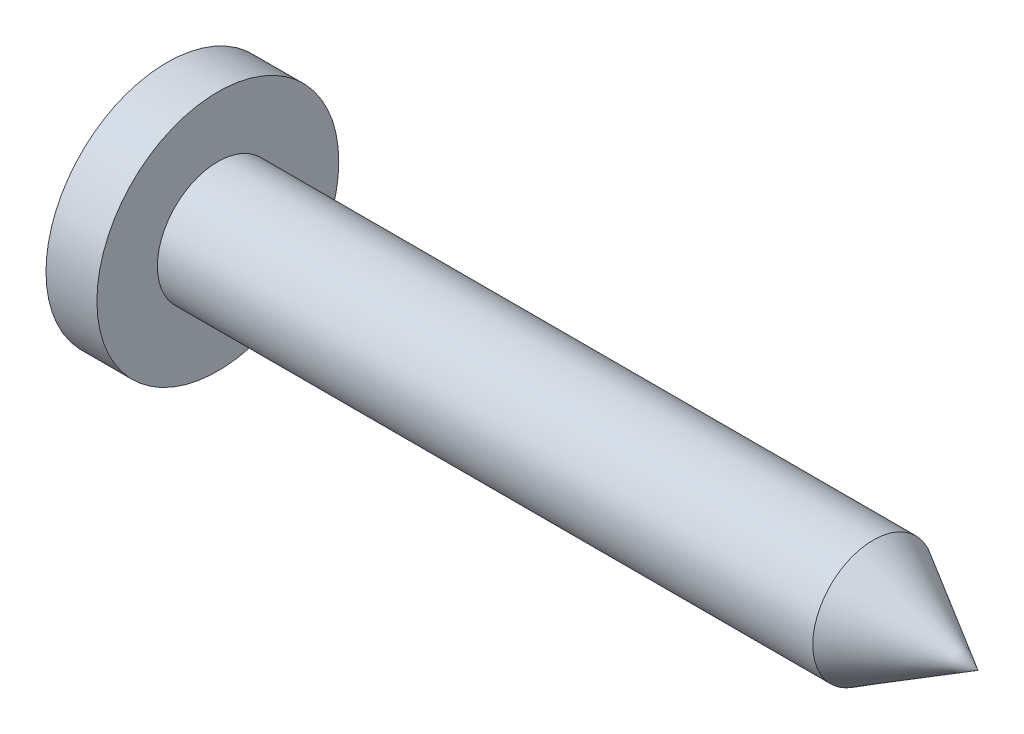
ISO-10303-21;
HEADER;
FILE_DESCRIPTION(('STEP AP214'),'2;1');
FILE_NAME('part.step','',(''),(''),'','','');
FILE_SCHEMA(('AUTOMOTIVE_DESIGN { 1 0 10303 214 1 1 1 1 }'));
ENDSEC;
DATA;
#1=APPLICATION_CONTEXT('core data for automotive mechanical design processes');
#2=APPLICATION_PROTOCOL_DEFINITION('international standard','automotive_design',2000,#1);
#3=PRODUCT_CONTEXT('',#1,'mechanical');
#4=PRODUCT('Part','Part','',(#3));
#5=PRODUCT_RELATED_PRODUCT_CATEGORY('part','',(#4));
#6=PRODUCT_DEFINITION_FORMATION('','',#4);
#7=PRODUCT_DEFINITION_CONTEXT('part definition',#1,'design');
#8=PRODUCT_DEFINITION('design','',#6,#7);
#9=PRODUCT_DEFINITION_SHAPE('','',#8);
#10=(LENGTH_UNIT() NAMED_UNIT(*) SI_UNIT(.MILLI.,.METRE.));
#11=(NAMED_UNIT(*) PLANE_ANGLE_UNIT() SI_UNIT($,.RADIAN.));
#12=(NAMED_UNIT(*) SI_UNIT($,.STERADIAN.) SOLID_ANGLE_UNIT());
#13=UNCERTAINTY_MEASURE_WITH_UNIT(LENGTH_MEASURE(1.E-05),#10,'distance_accuracy_value','');
#14=(GEOMETRIC_REPRESENTATION_CONTEXT(3) GLOBAL_UNCERTAINTY_ASSIGNED_CONTEXT((#13)) GLOBAL_UNIT_ASSIGNED_CONTEXT((#10,
#11,#12)) REPRESENTATION_CONTEXT('',''));
#15=CARTESIAN_POINT('',(0.,0.,0.));
#16=DIRECTION('',(0.,0.,1.));
#17=DIRECTION('',(1.,0.,0.));
#18=AXIS2_PLACEMENT_3D('',#15,#16,#17);
#19=CARTESIAN_POINT('',(3.4,0.,0.));
#20=DIRECTION('',(-1.,0.,0.));
#21=DIRECTION('',(0.,1.,0.));
#22=AXIS2_PLACEMENT_3D('',#19,#20,#21);
#23=SPHERICAL_SURFACE('',#22,6.);
#24=CARTESIAN_POINT('',(-1.47339717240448,0.,0.));
#25=DIRECTION('',(-1.,0.,0.));
#26=DIRECTION('',(0.,0.,1.));
#27=AXIS2_PLACEMENT_3D('',#24,#25,#26);
#28=CIRCLE('',#27,3.5);
#29=CARTESIAN_POINT('',(-1.47339717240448,0.,3.5));
#30=VERTEX_POINT('',#29);
#31=EDGE_CURVE('E629',#30,#30,#28,.T.);
#32=ORIENTED_EDGE('',*,*,#31,.T.);
#33=EDGE_LOOP('',(#32));
#34=FACE_BOUND('',#33,.T.);
#35=CARTESIAN_POINT('',(3.42159027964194,-0.177897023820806,0.102708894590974));
#36=DIRECTION('',(0.104528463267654,-0.861281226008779,0.497260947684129));
#37=DIRECTION('',(0.,-0.499999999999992,-0.866025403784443));
#38=AXIS2_PLACEMENT_3D('',#35,#36,#37);
#39=CIRCLE('',#38,5.9964437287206);
#40=CARTESIAN_POINT('',(-2.52565227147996,-0.497355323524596,0.799551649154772));
#41=VERTEX_POINT('',#40);
#42=CARTESIAN_POINT('',(-2.52418571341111,-0.4875,0.816313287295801));
#43=VERTEX_POINT('',#42);
#44=EDGE_CURVE('E650',#41,#43,#39,.F.);
#45=ORIENTED_EDGE('',*,*,#44,.F.);
#46=CARTESIAN_POINT('',(3.4,0.204156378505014,0.270924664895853));
#47=DIRECTION('',(0.,0.60181502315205,0.798635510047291));
#48=DIRECTION('',(0.,-0.798635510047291,0.60181502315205));
#49=AXIS2_PLACEMENT_3D('',#46,#47,#48);
#50=CIRCLE('',#49,5.99040232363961);
#51=CARTESIAN_POINT('',(-2.08257181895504,-1.72357277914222,1.72357277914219));
#52=VERTEX_POINT('',#51);
#53=EDGE_CURVE('E508',#41,#52,#50,.T.);
#54=ORIENTED_EDGE('',*,*,#53,.T.);
#55=CARTESIAN_POINT('',(3.4,-0.270924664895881,-0.204156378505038));
#56=DIRECTION('',(0.,0.798635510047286,0.601815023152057));
#57=DIRECTION('',(0.,-0.601815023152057,0.798635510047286));
#58=AXIS2_PLACEMENT_3D('',#55,#56,#57);
#59=CIRCLE('',#58,5.9904023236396);
#60=CARTESIAN_POINT('',(-2.52565227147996,-0.799551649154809,0.497355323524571));
#61=VERTEX_POINT('',#60);
#62=EDGE_CURVE('E506',#61,#52,#59,.T.);
#63=ORIENTED_EDGE('',*,*,#62,.F.);
#64=CARTESIAN_POINT('',(3.42159027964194,-0.102708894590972,0.177897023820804));
#65=DIRECTION('',(0.104528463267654,-0.497260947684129,0.861281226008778));
#66=DIRECTION('',(0.,-0.866025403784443,-0.499999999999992));
#67=AXIS2_PLACEMENT_3D('',#64,#65,#66);
#68=CIRCLE('',#67,5.9964437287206);
#69=CARTESIAN_POINT('',(-2.52418571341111,-0.816313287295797,0.4875));
#70=VERTEX_POINT('',#69);
#71=EDGE_CURVE('E647',#70,#61,#68,.F.);
#72=ORIENTED_EDGE('',*,*,#71,.F.);
#73=CARTESIAN_POINT('',(3.4,0.,0.4875));
#74=DIRECTION('',(0.,0.,-1.));
#75=DIRECTION('',(0.,1.,0.));
#76=AXIS2_PLACEMENT_3D('',#73,#74,#75);
#77=CIRCLE('',#76,5.98016251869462);
#78=CARTESIAN_POINT('',(-2.25330379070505,-1.95,0.4875));
#79=VERTEX_POINT('',#78);
#80=EDGE_CURVE('E504',#79,#70,#77,.T.);
#81=ORIENTED_EDGE('',*,*,#80,.F.);
#82=CARTESIAN_POINT('',(3.4,-1.95,0.));
#83=DIRECTION('',(0.,-1.,0.));
#84=DIRECTION('',(0.,0.,-1.));
#85=AXIS2_PLACEMENT_3D('',#82,#83,#84);
#86=CIRCLE('',#85,5.67428409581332);
#87=CARTESIAN_POINT('',(-2.25330379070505,-1.95,-0.4875));
#88=VERTEX_POINT('',#87);
#89=EDGE_CURVE('E11',#79,#88,#86,.T.);
#90=ORIENTED_EDGE('',*,*,#89,.T.);
#91=CARTESIAN_POINT('',(3.4,0.,-0.4875));
#92=DIRECTION('',(0.,0.,-1.));
#93=DIRECTION('',(0.,1.,0.));
#94=AXIS2_PLACEMENT_3D('',#91,#92,#93);
#95=CIRCLE('',#94,5.98016251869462);
#96=CARTESIAN_POINT('',(-2.52418571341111,-0.816313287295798,-0.4875));
#97=VERTEX_POINT('',#96);
#98=EDGE_CURVE('E501',#88,#97,#95,.T.);
#99=ORIENTED_EDGE('',*,*,#98,.T.);
#100=CARTESIAN_POINT('',(3.42159027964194,-0.102708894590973,-0.177897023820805));
#101=DIRECTION('',(0.104528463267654,-0.497260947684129,-0.861281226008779));
#102=DIRECTION('',(0.,0.866025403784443,-0.499999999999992));
#103=AXIS2_PLACEMENT_3D('',#100,#101,#102);
#104=CIRCLE('',#103,5.9964437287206);
#105=CARTESIAN_POINT('',(-2.52565227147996,-0.7995516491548,-0.497355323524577));
#106=VERTEX_POINT('',#105);
#107=EDGE_CURVE('E644',#106,#97,#104,.F.);
#108=ORIENTED_EDGE('',*,*,#107,.F.);
#109=CARTESIAN_POINT('',(3.4,-0.270924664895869,0.20415637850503));
#110=DIRECTION('',(0.,-0.798635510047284,0.60181502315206));
#111=DIRECTION('',(0.,-0.60181502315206,-0.798635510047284));
#112=AXIS2_PLACEMENT_3D('',#109,#110,#111);
#113=CIRCLE('',#112,5.9904023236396);
#114=CARTESIAN_POINT('',(-2.08257181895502,-1.72357277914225,-1.72357277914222));
#115=VERTEX_POINT('',#114);
#116=EDGE_CURVE('E498',#106,#115,#113,.T.);
#117=ORIENTED_EDGE('',*,*,#116,.T.);
#118=CARTESIAN_POINT('',(3.4,0.204156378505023,-0.270924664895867));
#119=DIRECTION('',(0.,0.60181502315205,-0.798635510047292));
#120=DIRECTION('',(0.,0.798635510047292,0.60181502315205));
#121=AXIS2_PLACEMENT_3D('',#118,#119,#120);
#122=CIRCLE('',#121,5.99040232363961);
#123=CARTESIAN_POINT('',(-2.52565227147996,-0.497355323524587,-0.799551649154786));
#124=VERTEX_POINT('',#123);
#125=EDGE_CURVE('E495',#115,#124,#122,.T.);
#126=ORIENTED_EDGE('',*,*,#125,.T.);
#127=CARTESIAN_POINT('',(3.42159027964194,-0.177897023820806,-0.102708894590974));
#128=DIRECTION('',(0.104528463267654,-0.861281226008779,-0.497260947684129));
#129=DIRECTION('',(0.,0.499999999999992,-0.866025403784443));
#130=AXIS2_PLACEMENT_3D('',#127,#128,#129);
#131=CIRCLE('',#130,5.9964437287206);
#132=CARTESIAN_POINT('',(-2.52418571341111,-0.4875,-0.816313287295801));
#133=VERTEX_POINT('',#132);
#134=EDGE_CURVE('E641',#133,#124,#131,.F.);
#135=ORIENTED_EDGE('',*,*,#134,.F.);
#136=CARTESIAN_POINT('',(3.4,-0.4875,0.));
#137=DIRECTION('',(0.,-1.,0.));
#138=DIRECTION('',(0.,0.,-1.));
#139=AXIS2_PLACEMENT_3D('',#136,#137,#138);
#140=CIRCLE('',#139,5.98016251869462);
#141=CARTESIAN_POINT('',(-2.25330379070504,-0.4875,-1.95));
#142=VERTEX_POINT('',#141);
#143=EDGE_CURVE('E492',#133,#142,#140,.T.);
#144=ORIENTED_EDGE('',*,*,#143,.T.);
#145=CARTESIAN_POINT('',(3.4,0.,-1.95));
#146=DIRECTION('',(0.,0.,-1.));
#147=DIRECTION('',(0.,1.,0.));
#148=AXIS2_PLACEMENT_3D('',#145,#146,#147);
#149=CIRCLE('',#148,5.67428409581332);
#150=CARTESIAN_POINT('',(-2.25330379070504,0.4875,-1.95));
#151=VERTEX_POINT('',#150);
#152=EDGE_CURVE('E24',#142,#151,#149,.T.);
#153=ORIENTED_EDGE('',*,*,#152,.T.);
#154=CARTESIAN_POINT('',(3.4,0.4875,0.));
#155=DIRECTION('',(0.,-1.,0.));
#156=DIRECTION('',(0.,0.,-1.));
#157=AXIS2_PLACEMENT_3D('',#154,#155,#156);
#158=CIRCLE('',#157,5.98016251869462);
#159=CARTESIAN_POINT('',(-2.52418571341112,0.4875,-0.816313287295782));
#160=VERTEX_POINT('',#159);
#161=EDGE_CURVE('E490',#160,#151,#158,.T.);
#162=ORIENTED_EDGE('',*,*,#161,.F.);
#163=CARTESIAN_POINT('',(3.42159027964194,0.177897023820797,-0.102708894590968));
#164=DIRECTION('',(0.104528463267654,0.861281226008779,-0.497260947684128));
#165=DIRECTION('',(0.,0.499999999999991,0.866025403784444));
#166=AXIS2_PLACEMENT_3D('',#163,#164,#165);
#167=CIRCLE('',#166,5.9964437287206);
#168=CARTESIAN_POINT('',(-2.52565227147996,0.497355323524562,-0.799551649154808));
#169=VERTEX_POINT('',#168);
#170=EDGE_CURVE('E638',#169,#160,#167,.F.);
#171=ORIENTED_EDGE('',*,*,#170,.F.);
#172=CARTESIAN_POINT('',(3.4,-0.20415637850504,-0.270924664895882));
#173=DIRECTION('',(0.,-0.60181502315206,-0.798635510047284));
#174=DIRECTION('',(0.,0.798635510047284,-0.60181502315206));
#175=AXIS2_PLACEMENT_3D('',#172,#173,#174);
#176=CIRCLE('',#175,5.9904023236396);
#177=CARTESIAN_POINT('',(-2.08257181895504,1.72357277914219,-1.72357277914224));
#178=VERTEX_POINT('',#177);
#179=EDGE_CURVE('E487',#169,#178,#176,.T.);
#180=ORIENTED_EDGE('',*,*,#179,.T.);
#181=CARTESIAN_POINT('',(3.4,0.270924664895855,0.204156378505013));
#182=DIRECTION('',(0.,-0.798635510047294,-0.601815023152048));
#183=DIRECTION('',(0.,0.601815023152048,-0.798635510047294));
#184=AXIS2_PLACEMENT_3D('',#181,#182,#183);
#185=CIRCLE('',#184,5.99040232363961);
#186=CARTESIAN_POINT('',(-2.52565227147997,0.799551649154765,-0.49735532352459));
#187=VERTEX_POINT('',#186);
#188=EDGE_CURVE('E485',#187,#178,#185,.T.);
#189=ORIENTED_EDGE('',*,*,#188,.F.);
#190=CARTESIAN_POINT('',(3.42159027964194,0.102708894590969,-0.177897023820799));
#191=DIRECTION('',(0.104528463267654,0.497260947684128,-0.861281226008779));
#192=DIRECTION('',(0.,0.866025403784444,0.499999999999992));
#193=AXIS2_PLACEMENT_3D('',#190,#191,#192);
#194=CIRCLE('',#193,5.9964437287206);
#195=CARTESIAN_POINT('',(-2.52418571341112,0.816313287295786,-0.4875));
#196=VERTEX_POINT('',#195);
#197=EDGE_CURVE('E635',#196,#187,#194,.F.);
#198=ORIENTED_EDGE('',*,*,#197,.F.);
#199=CARTESIAN_POINT('',(3.4,0.,-0.4875));
#200=DIRECTION('',(0.,0.,-1.));
#201=DIRECTION('',(0.,1.,0.));
#202=AXIS2_PLACEMENT_3D('',#199,#200,#201);
#203=CIRCLE('',#202,5.98016251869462);
#204=CARTESIAN_POINT('',(-2.25330379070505,1.95,-0.4875));
#205=VERTEX_POINT('',#204);
#206=EDGE_CURVE('E39',#196,#205,#203,.T.);
#207=ORIENTED_EDGE('',*,*,#206,.T.);
#208=CARTESIAN_POINT('',(3.4,1.95,0.));
#209=DIRECTION('',(0.,-1.,0.));
#210=DIRECTION('',(0.,0.,-1.));
#211=AXIS2_PLACEMENT_3D('',#208,#209,#210);
#212=CIRCLE('',#211,5.67428409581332);
#213=CARTESIAN_POINT('',(-2.25330379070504,1.95,0.4875));
#214=VERTEX_POINT('',#213);
#215=EDGE_CURVE('E702',#214,#205,#212,.T.);
#216=ORIENTED_EDGE('',*,*,#215,.F.);
#217=CARTESIAN_POINT('',(3.4,0.,0.4875));
#218=DIRECTION('',(0.,0.,-1.));
#219=DIRECTION('',(0.,1.,0.));
#220=AXIS2_PLACEMENT_3D('',#217,#218,#219);
#221=CIRCLE('',#220,5.98016251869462);
#222=CARTESIAN_POINT('',(-2.52418571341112,0.816313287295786,0.4875));
#223=VERTEX_POINT('',#222);
#224=EDGE_CURVE('E520',#223,#214,#221,.T.);
#225=ORIENTED_EDGE('',*,*,#224,.F.);
#226=CARTESIAN_POINT('',(3.42159027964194,0.10270889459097,0.177897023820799));
#227=DIRECTION('',(0.104528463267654,0.497260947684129,0.861281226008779));
#228=DIRECTION('',(0.,-0.866025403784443,0.499999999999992));
#229=AXIS2_PLACEMENT_3D('',#226,#227,#228);
#230=CIRCLE('',#229,5.9964437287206);
#231=CARTESIAN_POINT('',(-2.52565227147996,0.799551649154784,0.497355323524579));
#232=VERTEX_POINT('',#231);
#233=EDGE_CURVE('E656',#232,#223,#230,.F.);
#234=ORIENTED_EDGE('',*,*,#233,.F.);
#235=CARTESIAN_POINT('',(3.4,0.27092466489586,-0.204156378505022));
#236=DIRECTION('',(0.,-0.798635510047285,0.601815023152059));
#237=DIRECTION('',(0.,-0.601815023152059,-0.798635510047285));
#238=AXIS2_PLACEMENT_3D('',#235,#236,#237);
#239=CIRCLE('',#238,5.99040232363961);
#240=CARTESIAN_POINT('',(-2.08257181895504,1.72357277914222,1.72357277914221));
#241=VERTEX_POINT('',#240);
#242=EDGE_CURVE('E518',#241,#232,#239,.T.);
#243=ORIENTED_EDGE('',*,*,#242,.F.);
#244=CARTESIAN_POINT('',(3.4,-0.204156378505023,0.270924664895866));
#245=DIRECTION('',(0.,0.601815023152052,-0.79863551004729));
#246=DIRECTION('',(0.,0.798635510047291,0.601815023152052));
#247=AXIS2_PLACEMENT_3D('',#244,#245,#246);
#248=CIRCLE('',#247,5.99040232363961);
#249=CARTESIAN_POINT('',(-2.52565227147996,0.497355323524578,0.799551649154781));
#250=VERTEX_POINT('',#249);
#251=EDGE_CURVE('E516',#250,#241,#248,.T.);
#252=ORIENTED_EDGE('',*,*,#251,.F.);
#253=CARTESIAN_POINT('',(3.42159027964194,0.177897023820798,0.102708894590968));
#254=DIRECTION('',(0.104528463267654,0.861281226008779,0.497260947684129));
#255=DIRECTION('',(0.,-0.499999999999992,0.866025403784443));
#256=AXIS2_PLACEMENT_3D('',#253,#254,#255);
#257=CIRCLE('',#256,5.9964437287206);
#258=CARTESIAN_POINT('',(-2.52418571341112,0.4875,0.816313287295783));
#259=VERTEX_POINT('',#258);
#260=EDGE_CURVE('E653',#259,#250,#257,.F.);
#261=ORIENTED_EDGE('',*,*,#260,.F.);
#262=CARTESIAN_POINT('',(3.4,0.4875,0.));
#263=DIRECTION('',(0.,-1.,0.));
#264=DIRECTION('',(0.,0.,-1.));
#265=AXIS2_PLACEMENT_3D('',#262,#263,#264);
#266=CIRCLE('',#265,5.98016251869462);
#267=CARTESIAN_POINT('',(-2.25330379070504,0.4875,1.95));
#268=VERTEX_POINT('',#267);
#269=EDGE_CURVE('E514',#268,#259,#266,.T.);
#270=ORIENTED_EDGE('',*,*,#269,.F.);
#271=CARTESIAN_POINT('',(3.4,0.,1.95));
#272=DIRECTION('',(0.,0.,-1.));
#273=DIRECTION('',(0.,1.,0.));
#274=AXIS2_PLACEMENT_3D('',#271,#272,#273);
#275=CIRCLE('',#274,5.67428409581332);
#276=CARTESIAN_POINT('',(-2.25330379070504,-0.4875,1.95));
#277=VERTEX_POINT('',#276);
#278=EDGE_CURVE('E700',#277,#268,#275,.T.);
#279=ORIENTED_EDGE('',*,*,#278,.F.);
#280=CARTESIAN_POINT('',(3.4,-0.4875,0.));
#281=DIRECTION('',(0.,-1.,0.));
#282=DIRECTION('',(0.,0.,-1.));
#283=AXIS2_PLACEMENT_3D('',#280,#281,#282);
#284=CIRCLE('',#283,5.98016251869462);
#285=EDGE_CURVE('E511',#277,#43,#284,.T.);
#286=ORIENTED_EDGE('',*,*,#285,.T.);
#287=EDGE_LOOP('',(#45,#54,#63,#72,#81,#90,#99,#108,#117,#126,#135,#144,#153,#162,#171,#180,
#189,#198,#207,#216,#225,#234,#243,#252,#261,#270,#279,#286));
#288=FACE_BOUND('',#287,.T.);
#289=ADVANCED_FACE('F16',(#34,#288),#23,.T.);
#290=CARTESIAN_POINT('',(-2.6,1.17,0.2925));
#291=DIRECTION('',(0.104528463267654,0.497260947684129,0.861281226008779));
#292=DIRECTION('',(0.,-0.866025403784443,0.499999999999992));
#293=AXIS2_PLACEMENT_3D('',#290,#291,#292);
#294=PLANE('',#293);
#295=ORIENTED_EDGE('',*,*,#233,.T.);
#296=DIRECTION('',(-0.978612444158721,0.205712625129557,0.));
#297=VECTOR('',#296,1.);
#298=CARTESIAN_POINT('',(-2.66799342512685,0.846542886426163,0.4875));
#299=LINE('',#298,#297);
#300=CARTESIAN_POINT('',(-2.40911824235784,0.792125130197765,0.4875));
#301=VERTEX_POINT('',#300);
#302=EDGE_CURVE('E697',#223,#301,#299,.F.);
#303=ORIENTED_EDGE('',*,*,#302,.T.);
#304=DIRECTION('',(0.994439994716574,-0.0633739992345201,-0.0841001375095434));
#305=VECTOR('',#304,1.);
#306=CARTESIAN_POINT('',(-2.60538924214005,0.804633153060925,0.504098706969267));
#307=LINE('',#306,#305);
#308=EDGE_CURVE('E694',#301,#232,#307,.F.);
#309=ORIENTED_EDGE('',*,*,#308,.T.);
#310=EDGE_LOOP('',(#295,#303,#309));
#311=FACE_BOUND('',#310,.T.);
#312=ADVANCED_FACE('F782',(#311),#294,.F.);
#313=CARTESIAN_POINT('',(-2.6,0.292499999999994,1.17));
#314=DIRECTION('',(0.104528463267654,0.861281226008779,0.497260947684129));
#315=DIRECTION('',(0.,-0.499999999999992,0.866025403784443));
#316=AXIS2_PLACEMENT_3D('',#313,#314,#315);
#317=PLANE('',#316);
#318=ORIENTED_EDGE('',*,*,#260,.T.);
#319=DIRECTION('',(-0.994439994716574,0.0841001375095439,0.0633739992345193));
#320=VECTOR('',#319,1.);
#321=CARTESIAN_POINT('',(-2.60538924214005,0.504098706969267,0.804633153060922));
#322=LINE('',#321,#320);
#323=CARTESIAN_POINT('',(-2.40911824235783,0.4875,0.79212513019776));
#324=VERTEX_POINT('',#323);
#325=EDGE_CURVE('E691',#250,#324,#322,.F.);
#326=ORIENTED_EDGE('',*,*,#325,.T.);
#327=DIRECTION('',(0.978612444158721,0.,-0.205712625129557));
#328=VECTOR('',#327,1.);
#329=CARTESIAN_POINT('',(-2.66799342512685,0.4875,0.846542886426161));
#330=LINE('',#329,#328);
#331=EDGE_CURVE('E688',#324,#259,#330,.F.);
#332=ORIENTED_EDGE('',*,*,#331,.T.);
#333=EDGE_LOOP('',(#318,#326,#332));
#334=FACE_BOUND('',#333,.T.);
#335=ADVANCED_FACE('F762',(#334),#317,.F.);
#336=CARTESIAN_POINT('',(-2.6,-0.292500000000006,1.17));
#337=DIRECTION('',(0.104528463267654,-0.861281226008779,0.497260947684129));
#338=DIRECTION('',(0.,-0.499999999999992,-0.866025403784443));
#339=AXIS2_PLACEMENT_3D('',#336,#337,#338);
#340=PLANE('',#339);
#341=DIRECTION('',(0.978612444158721,0.,-0.205712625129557));
#342=VECTOR('',#341,1.);
#343=CARTESIAN_POINT('',(-2.66799342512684,-0.4875,0.846542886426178));
#344=LINE('',#343,#342);
#345=CARTESIAN_POINT('',(-2.40911824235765,-0.4875,0.79212513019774));
#346=VERTEX_POINT('',#345);
#347=EDGE_CURVE('E686',#346,#43,#344,.F.);
#348=ORIENTED_EDGE('',*,*,#347,.F.);
#349=DIRECTION('',(-0.994439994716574,-0.0841001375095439,0.0633739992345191));
#350=VECTOR('',#349,1.);
#351=CARTESIAN_POINT('',(-2.60538924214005,-0.504098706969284,0.804633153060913));
#352=LINE('',#351,#350);
#353=EDGE_CURVE('E332',#41,#346,#352,.F.);
#354=ORIENTED_EDGE('',*,*,#353,.F.);
#355=ORIENTED_EDGE('',*,*,#44,.T.);
#356=EDGE_LOOP('',(#348,#354,#355));
#357=FACE_BOUND('',#356,.T.);
#358=ADVANCED_FACE('F960',(#357),#340,.F.);
#359=CARTESIAN_POINT('',(-2.6,-1.17000000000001,0.2925));
#360=DIRECTION('',(0.104528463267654,-0.497260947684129,0.861281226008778));
#361=DIRECTION('',(0.,-0.866025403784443,-0.499999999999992));
#362=AXIS2_PLACEMENT_3D('',#359,#360,#361);
#363=PLANE('',#362);
#364=ORIENTED_EDGE('',*,*,#71,.T.);
#365=DIRECTION('',(-0.994439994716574,-0.0633739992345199,0.0841001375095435));
#366=VECTOR('',#365,1.);
#367=CARTESIAN_POINT('',(-2.60538924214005,-0.804633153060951,0.504098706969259));
#368=LINE('',#367,#366);
#369=CARTESIAN_POINT('',(-2.40911824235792,-0.792125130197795,0.4875));
#370=VERTEX_POINT('',#369);
#371=EDGE_CURVE('E682',#61,#370,#368,.F.);
#372=ORIENTED_EDGE('',*,*,#371,.T.);
#373=DIRECTION('',(0.978612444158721,0.205712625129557,0.));
#374=VECTOR('',#373,1.);
#375=CARTESIAN_POINT('',(-2.66799342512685,-0.846542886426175,0.4875));
#376=LINE('',#375,#374);
#377=EDGE_CURVE('E679',#370,#70,#376,.F.);
#378=ORIENTED_EDGE('',*,*,#377,.T.);
#379=EDGE_LOOP('',(#364,#372,#378));
#380=FACE_BOUND('',#379,.T.);
#381=ADVANCED_FACE('F957',(#380),#363,.F.);
#382=CARTESIAN_POINT('',(-2.6,-1.17000000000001,-0.2925));
#383=DIRECTION('',(0.104528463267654,-0.497260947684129,-0.861281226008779));
#384=DIRECTION('',(0.,0.866025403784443,-0.499999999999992));
#385=AXIS2_PLACEMENT_3D('',#382,#383,#384);
#386=PLANE('',#385);
#387=DIRECTION('',(0.978612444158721,0.205712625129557,0.));
#388=VECTOR('',#387,1.);
#389=CARTESIAN_POINT('',(-2.66799342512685,-0.846542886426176,-0.4875));
#390=LINE('',#389,#388);
#391=CARTESIAN_POINT('',(-2.40911824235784,-0.792125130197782,-0.4875));
#392=VERTEX_POINT('',#391);
#393=EDGE_CURVE('E677',#392,#97,#390,.F.);
#394=ORIENTED_EDGE('',*,*,#393,.F.);
#395=DIRECTION('',(-0.994439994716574,-0.0633739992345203,-0.0841001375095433));
#396=VECTOR('',#395,1.);
#397=CARTESIAN_POINT('',(-2.60538924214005,-0.804633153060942,-0.504098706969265));
#398=LINE('',#397,#396);
#399=EDGE_CURVE('E675',#106,#392,#398,.F.);
#400=ORIENTED_EDGE('',*,*,#399,.F.);
#401=ORIENTED_EDGE('',*,*,#107,.T.);
#402=EDGE_LOOP('',(#394,#400,#401));
#403=FACE_BOUND('',#402,.T.);
#404=ADVANCED_FACE('F948',(#403),#386,.F.);
#405=CARTESIAN_POINT('',(-2.6,-0.292500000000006,-1.17));
#406=DIRECTION('',(0.104528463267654,-0.861281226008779,-0.497260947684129));
#407=DIRECTION('',(0.,0.499999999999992,-0.866025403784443));
#408=AXIS2_PLACEMENT_3D('',#405,#406,#407);
#409=PLANE('',#408);
#410=DIRECTION('',(0.994439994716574,0.084100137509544,0.0633739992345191));
#411=VECTOR('',#410,1.);
#412=CARTESIAN_POINT('',(-2.60538924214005,-0.504098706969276,-0.804633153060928));
#413=LINE('',#412,#411);
#414=CARTESIAN_POINT('',(-2.40911824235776,-0.4875,-0.792125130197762));
#415=VERTEX_POINT('',#414);
#416=EDGE_CURVE('E673',#415,#124,#413,.F.);
#417=ORIENTED_EDGE('',*,*,#416,.F.);
#418=DIRECTION('',(-0.978612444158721,0.,-0.205712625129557));
#419=VECTOR('',#418,1.);
#420=CARTESIAN_POINT('',(-2.66799342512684,-0.4875,-0.846542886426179));
#421=LINE('',#420,#419);
#422=EDGE_CURVE('E671',#133,#415,#421,.F.);
#423=ORIENTED_EDGE('',*,*,#422,.F.);
#424=ORIENTED_EDGE('',*,*,#134,.T.);
#425=EDGE_LOOP('',(#417,#423,#424));
#426=FACE_BOUND('',#425,.T.);
#427=ADVANCED_FACE('F827',(#426),#409,.F.);
#428=CARTESIAN_POINT('',(-2.6,0.292499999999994,-1.17));
#429=DIRECTION('',(0.104528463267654,0.861281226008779,-0.497260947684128));
#430=DIRECTION('',(0.,0.499999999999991,0.866025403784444));
#431=AXIS2_PLACEMENT_3D('',#428,#429,#430);
#432=PLANE('',#431);
#433=ORIENTED_EDGE('',*,*,#170,.T.);
#434=DIRECTION('',(-0.978612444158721,0.,-0.205712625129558));
#435=VECTOR('',#434,1.);
#436=CARTESIAN_POINT('',(-2.66799342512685,0.4875,-0.84654288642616));
#437=LINE('',#436,#435);
#438=CARTESIAN_POINT('',(-2.40911824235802,0.4875,-0.7921251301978));
#439=VERTEX_POINT('',#438);
#440=EDGE_CURVE('E668',#160,#439,#437,.F.);
#441=ORIENTED_EDGE('',*,*,#440,.T.);
#442=DIRECTION('',(-0.994439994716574,0.0841001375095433,-0.0633739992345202));
#443=VECTOR('',#442,1.);
#444=CARTESIAN_POINT('',(-2.60538924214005,0.504098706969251,-0.80463315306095));
#445=LINE('',#444,#443);
#446=EDGE_CURVE('E666',#169,#439,#445,.F.);
#447=ORIENTED_EDGE('',*,*,#446,.F.);
#448=EDGE_LOOP('',(#433,#441,#447));
#449=FACE_BOUND('',#448,.T.);
#450=ADVANCED_FACE('F727',(#449),#432,.F.);
#451=CARTESIAN_POINT('',(-2.6,1.17,-0.2925));
#452=DIRECTION('',(0.104528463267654,0.497260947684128,-0.861281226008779));
#453=DIRECTION('',(0.,0.866025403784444,0.499999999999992));
#454=AXIS2_PLACEMENT_3D('',#451,#452,#453);
#455=PLANE('',#454);
#456=ORIENTED_EDGE('',*,*,#197,.T.);
#457=DIRECTION('',(-0.994439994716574,0.0633739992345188,-0.0841001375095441));
#458=VECTOR('',#457,1.);
#459=CARTESIAN_POINT('',(-2.60538924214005,0.804633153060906,-0.504098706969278));
#460=LINE('',#459,#458);
#461=CARTESIAN_POINT('',(-2.40911824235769,0.792125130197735,-0.4875));
#462=VERTEX_POINT('',#461);
#463=EDGE_CURVE('E663',#187,#462,#460,.F.);
#464=ORIENTED_EDGE('',*,*,#463,.T.);
#465=DIRECTION('',(-0.978612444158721,0.205712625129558,0.));
#466=VECTOR('',#465,1.);
#467=CARTESIAN_POINT('',(-2.66799342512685,0.846542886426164,-0.4875));
#468=LINE('',#467,#466);
#469=EDGE_CURVE('E661',#196,#462,#468,.F.);
#470=ORIENTED_EDGE('',*,*,#469,.F.);
#471=EDGE_LOOP('',(#456,#464,#470));
#472=FACE_BOUND('',#471,.T.);
#473=ADVANCED_FACE('F732',(#472),#455,.F.);
#474=CARTESIAN_POINT('',(0.,0.,0.));
#475=DIRECTION('',(-1.,0.,0.));
#476=DIRECTION('',(0.,0.,1.));
#477=AXIS2_PLACEMENT_3D('',#474,#475,#476);
#478=CYLINDRICAL_SURFACE('',#477,1.75);
#479=CARTESIAN_POINT('',(0.,0.,0.));
#480=DIRECTION('',(-1.,0.,0.));
#481=DIRECTION('',(0.,0.,1.));
#482=AXIS2_PLACEMENT_3D('',#479,#480,#481);
#483=CIRCLE('',#482,1.75);
#484=CARTESIAN_POINT('',(0.,0.,1.75));
#485=VERTEX_POINT('',#484);
#486=EDGE_CURVE('E626',#485,#485,#483,.T.);
#487=ORIENTED_EDGE('',*,*,#486,.F.);
#488=EDGE_LOOP('',(#487));
#489=FACE_BOUND('',#488,.T.);
#490=CARTESIAN_POINT('',(18.9689110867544,0.,0.));
#491=DIRECTION('',(-1.,0.,0.));
#492=DIRECTION('',(0.,0.,1.));
#493=AXIS2_PLACEMENT_3D('',#490,#491,#492);
#494=CIRCLE('',#493,1.75);
#495=CARTESIAN_POINT('',(18.9689110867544,0.,1.75));
#496=VERTEX_POINT('',#495);
#497=EDGE_CURVE('E526',#496,#496,#494,.T.);
#498=ORIENTED_EDGE('',*,*,#497,.T.);
#499=EDGE_LOOP('',(#498));
#500=FACE_BOUND('',#499,.T.);
#501=ADVANCED_FACE('F793',(#489,#500),#478,.T.);
#502=CARTESIAN_POINT('',(0.,1.75,0.));
#503=DIRECTION('',(-1.,0.,0.));
#504=DIRECTION('',(0.,0.,1.));
#505=AXIS2_PLACEMENT_3D('',#502,#503,#504);
#506=PLANE('',#505);
#507=CARTESIAN_POINT('',(0.,0.,0.));
#508=DIRECTION('',(-1.,0.,0.));
#509=DIRECTION('',(0.,0.,1.));
#510=AXIS2_PLACEMENT_3D('',#507,#508,#509);
#511=CIRCLE('',#510,3.5);
#512=CARTESIAN_POINT('',(0.,0.,3.5));
#513=VERTEX_POINT('',#512);
#514=EDGE_CURVE('E632',#513,#513,#511,.T.);
#515=ORIENTED_EDGE('',*,*,#514,.F.);
#516=EDGE_LOOP('',(#515));
#517=FACE_BOUND('',#516,.T.);
#518=ORIENTED_EDGE('',*,*,#486,.T.);
#519=EDGE_LOOP('',(#518));
#520=FACE_BOUND('',#519,.T.);
#521=ADVANCED_FACE('F18',(#517,#520),#506,.F.);
#522=CARTESIAN_POINT('',(0.,0.,0.));
#523=DIRECTION('',(-1.,0.,0.));
#524=DIRECTION('',(0.,0.,1.));
#525=AXIS2_PLACEMENT_3D('',#522,#523,#524);
#526=CYLINDRICAL_SURFACE('',#525,3.5);
#527=ORIENTED_EDGE('',*,*,#31,.F.);
#528=EDGE_LOOP('',(#527));
#529=FACE_BOUND('',#528,.T.);
#530=ORIENTED_EDGE('',*,*,#514,.T.);
#531=EDGE_LOOP('',(#530));
#532=FACE_BOUND('',#531,.T.);
#533=ADVANCED_FACE('F795',(#529,#532),#526,.T.);
#534=CARTESIAN_POINT('',(18.9689110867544,0.,0.));
#535=DIRECTION('',(-1.,0.,0.));
#536=DIRECTION('',(0.,0.,1.));
#537=AXIS2_PLACEMENT_3D('',#534,#535,#536);
#538=CONICAL_SURFACE('',#537,1.75,0.523598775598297);
#539=CARTESIAN_POINT('',(22.,0.,0.));
#540=VERTEX_POINT('',#539);
#541=VERTEX_LOOP('',#540);
#542=FACE_BOUND('',#541,.T.);
#543=ORIENTED_EDGE('',*,*,#497,.F.);
#544=EDGE_LOOP('',(#543));
#545=FACE_BOUND('',#544,.T.);
#546=ADVANCED_FACE('F797',(#542,#545),#538,.T.);
#547=CARTESIAN_POINT('',(-1.3,-1.95,-4.13378680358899));
#548=DIRECTION('',(0.,-1.,0.));
#549=DIRECTION('',(0.,0.,-1.));
#550=AXIS2_PLACEMENT_3D('',#547,#548,#549);
#551=PLANE('',#550);
#552=DIRECTION('',(-1.,0.,0.));
#553=VECTOR('',#552,1.);
#554=CARTESIAN_POINT('',(-1.3,-1.95,0.4875));
#555=LINE('',#554,#553);
#556=CARTESIAN_POINT('',(-1.3,-1.95,0.4875));
#557=VERTEX_POINT('',#556);
#558=EDGE_CURVE('E440',#557,#79,#555,.T.);
#559=ORIENTED_EDGE('',*,*,#558,.F.);
#560=DIRECTION('',(0.,0.,1.));
#561=VECTOR('',#560,1.);
#562=CARTESIAN_POINT('',(-1.3,-1.95,-4.13378680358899));
#563=LINE('',#562,#561);
#564=CARTESIAN_POINT('',(-1.3,-1.95,-0.4875));
#565=VERTEX_POINT('',#564);
#566=EDGE_CURVE('E355',#565,#557,#563,.T.);
#567=ORIENTED_EDGE('',*,*,#566,.F.);
#568=DIRECTION('',(-1.,0.,0.));
#569=VECTOR('',#568,1.);
#570=CARTESIAN_POINT('',(-1.3,-1.95,-0.4875));
#571=LINE('',#570,#569);
#572=EDGE_CURVE('E437',#565,#88,#571,.T.);
#573=ORIENTED_EDGE('',*,*,#572,.T.);
#574=ORIENTED_EDGE('',*,*,#89,.F.);
#575=EDGE_LOOP('',(#559,#567,#573,#574));
#576=FACE_BOUND('',#575,.T.);
#577=ADVANCED_FACE('F804',(#576),#551,.F.);
#578=CARTESIAN_POINT('',(-1.3,0.0298034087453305,-1.95));
#579=DIRECTION('',(0.,0.,-1.));
#580=DIRECTION('',(0.,1.,0.));
#581=AXIS2_PLACEMENT_3D('',#578,#579,#580);
#582=PLANE('',#581);
#583=DIRECTION('',(-1.,0.,0.));
#584=VECTOR('',#583,1.);
#585=CARTESIAN_POINT('',(-1.3,-0.4875,-1.95));
#586=LINE('',#585,#584);
#587=CARTESIAN_POINT('',(-1.3,-0.4875,-1.95));
#588=VERTEX_POINT('',#587);
#589=EDGE_CURVE('E425',#588,#142,#586,.T.);
#590=ORIENTED_EDGE('',*,*,#589,.F.);
#591=DIRECTION('',(0.,-1.,0.));
#592=VECTOR('',#591,1.);
#593=CARTESIAN_POINT('',(-1.3,0.0298034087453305,-1.95));
#594=LINE('',#593,#592);
#595=CARTESIAN_POINT('',(-1.3,0.4875,-1.95));
#596=VERTEX_POINT('',#595);
#597=EDGE_CURVE('E370',#596,#588,#594,.T.);
#598=ORIENTED_EDGE('',*,*,#597,.F.);
#599=DIRECTION('',(-1.,0.,0.));
#600=VECTOR('',#599,1.);
#601=CARTESIAN_POINT('',(-1.3,0.4875,-1.95));
#602=LINE('',#601,#600);
#603=EDGE_CURVE('E422',#596,#151,#602,.T.);
#604=ORIENTED_EDGE('',*,*,#603,.T.);
#605=ORIENTED_EDGE('',*,*,#152,.F.);
#606=EDGE_LOOP('',(#590,#598,#604,#605));
#607=FACE_BOUND('',#606,.T.);
#608=ADVANCED_FACE('F710',(#607),#582,.F.);
#609=CARTESIAN_POINT('',(-1.3,1.95,-4.13378680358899));
#610=DIRECTION('',(0.,-1.,0.));
#611=DIRECTION('',(0.,0.,-1.));
#612=AXIS2_PLACEMENT_3D('',#609,#610,#611);
#613=PLANE('',#612);
#614=ORIENTED_EDGE('',*,*,#215,.T.);
#615=DIRECTION('',(-1.,0.,0.));
#616=VECTOR('',#615,1.);
#617=CARTESIAN_POINT('',(-1.3,1.95,-0.4875));
#618=LINE('',#617,#616);
#619=CARTESIAN_POINT('',(-1.3,1.95,-0.4875));
#620=VERTEX_POINT('',#619);
#621=EDGE_CURVE('E411',#620,#205,#618,.T.);
#622=ORIENTED_EDGE('',*,*,#621,.F.);
#623=DIRECTION('',(0.,0.,1.));
#624=VECTOR('',#623,1.);
#625=CARTESIAN_POINT('',(-1.3,1.95,-4.13378680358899));
#626=LINE('',#625,#624);
#627=CARTESIAN_POINT('',(-1.3,1.95,0.4875));
#628=VERTEX_POINT('',#627);
#629=EDGE_CURVE('E383',#620,#628,#626,.T.);
#630=ORIENTED_EDGE('',*,*,#629,.T.);
#631=DIRECTION('',(-1.,0.,0.));
#632=VECTOR('',#631,1.);
#633=CARTESIAN_POINT('',(-1.3,1.95,0.4875));
#634=LINE('',#633,#632);
#635=EDGE_CURVE('E408',#628,#214,#634,.T.);
#636=ORIENTED_EDGE('',*,*,#635,.T.);
#637=EDGE_LOOP('',(#614,#622,#630,#636));
#638=FACE_BOUND('',#637,.T.);
#639=ADVANCED_FACE('F743',(#638),#613,.T.);
#640=CARTESIAN_POINT('',(-1.3,0.0298034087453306,1.95));
#641=DIRECTION('',(0.,0.,-1.));
#642=DIRECTION('',(0.,1.,0.));
#643=AXIS2_PLACEMENT_3D('',#640,#641,#642);
#644=PLANE('',#643);
#645=ORIENTED_EDGE('',*,*,#278,.T.);
#646=DIRECTION('',(-1.,0.,0.));
#647=VECTOR('',#646,1.);
#648=CARTESIAN_POINT('',(-1.3,0.4875,1.95));
#649=LINE('',#648,#647);
#650=CARTESIAN_POINT('',(-1.3,0.4875,1.95));
#651=VERTEX_POINT('',#650);
#652=EDGE_CURVE('E396',#651,#268,#649,.T.);
#653=ORIENTED_EDGE('',*,*,#652,.F.);
#654=DIRECTION('',(0.,-1.,0.));
#655=VECTOR('',#654,1.);
#656=CARTESIAN_POINT('',(-1.3,0.0298034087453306,1.95));
#657=LINE('',#656,#655);
#658=CARTESIAN_POINT('',(-1.3,-0.4875,1.95));
#659=VERTEX_POINT('',#658);
#660=EDGE_CURVE('E393',#651,#659,#657,.T.);
#661=ORIENTED_EDGE('',*,*,#660,.T.);
#662=DIRECTION('',(-1.,0.,0.));
#663=VECTOR('',#662,1.);
#664=CARTESIAN_POINT('',(-1.3,-0.4875,1.95));
#665=LINE('',#664,#663);
#666=EDGE_CURVE('E342',#659,#277,#665,.T.);
#667=ORIENTED_EDGE('',*,*,#666,.T.);
#668=EDGE_LOOP('',(#645,#653,#661,#667));
#669=FACE_BOUND('',#668,.T.);
#670=ADVANCED_FACE('F768',(#669),#644,.T.);
#671=CARTESIAN_POINT('',(-1.3,0.0298034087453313,0.4875));
#672=DIRECTION('',(0.,0.,-1.));
#673=DIRECTION('',(0.,1.,0.));
#674=AXIS2_PLACEMENT_3D('',#671,#672,#673);
#675=PLANE('',#674);
#676=ORIENTED_EDGE('',*,*,#224,.T.);
#677=ORIENTED_EDGE('',*,*,#635,.F.);
#678=DIRECTION('',(0.,-1.,0.));
#679=VECTOR('',#678,1.);
#680=CARTESIAN_POINT('',(-1.3,0.0298034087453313,0.4875));
#681=LINE('',#680,#679);
#682=CARTESIAN_POINT('',(-1.3,0.792125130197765,0.4875));
#683=VERTEX_POINT('',#682);
#684=EDGE_CURVE('E385',#628,#683,#681,.T.);
#685=ORIENTED_EDGE('',*,*,#684,.T.);
#686=DIRECTION('',(-1.,0.,0.));
#687=VECTOR('',#686,1.);
#688=CARTESIAN_POINT('',(-1.3,0.792125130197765,0.4875));
#689=LINE('',#688,#687);
#690=EDGE_CURVE('E405',#683,#301,#689,.T.);
#691=ORIENTED_EDGE('',*,*,#690,.T.);
#692=ORIENTED_EDGE('',*,*,#302,.F.);
#693=EDGE_LOOP('',(#676,#677,#685,#691,#692));
#694=FACE_BOUND('',#693,.T.);
#695=ADVANCED_FACE('F746',(#694),#675,.T.);
#696=CARTESIAN_POINT('',(-1.3,-1.70510655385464,-2.82643837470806));
#697=DIRECTION('',(0.,-0.798635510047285,0.601815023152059));
#698=DIRECTION('',(0.,-0.601815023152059,-0.798635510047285));
#699=AXIS2_PLACEMENT_3D('',#696,#697,#698);
#700=PLANE('',#699);
#701=ORIENTED_EDGE('',*,*,#242,.T.);
#702=ORIENTED_EDGE('',*,*,#308,.F.);
#703=ORIENTED_EDGE('',*,*,#690,.F.);
#704=DIRECTION('',(0.,0.601815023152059,0.798635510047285));
#705=VECTOR('',#704,1.);
#706=CARTESIAN_POINT('',(-1.3,-1.70510655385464,-2.82643837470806));
#707=LINE('',#706,#705);
#708=CARTESIAN_POINT('',(-1.3,1.72357277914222,1.72357277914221));
#709=VERTEX_POINT('',#708);
#710=EDGE_CURVE('E387',#683,#709,#707,.T.);
#711=ORIENTED_EDGE('',*,*,#710,.T.);
#712=DIRECTION('',(-1.,0.,0.));
#713=VECTOR('',#712,1.);
#714=CARTESIAN_POINT('',(-1.3,1.72357277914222,1.72357277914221));
#715=LINE('',#714,#713);
#716=EDGE_CURVE('E402',#709,#241,#715,.T.);
#717=ORIENTED_EDGE('',*,*,#716,.T.);
#718=EDGE_LOOP('',(#701,#702,#703,#711,#717));
#719=FACE_BOUND('',#718,.T.);
#720=ADVANCED_FACE('F753',(#719),#700,.T.);
#721=CARTESIAN_POINT('',(-1.3,-2.17197266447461,-1.21193126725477));
#722=DIRECTION('',(0.,0.601815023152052,-0.79863551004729));
#723=DIRECTION('',(0.,0.798635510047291,0.601815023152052));
#724=AXIS2_PLACEMENT_3D('',#721,#722,#723);
#725=PLANE('',#724);
#726=ORIENTED_EDGE('',*,*,#251,.T.);
#727=ORIENTED_EDGE('',*,*,#716,.F.);
#728=DIRECTION('',(0.,-0.79863551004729,-0.601815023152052));
#729=VECTOR('',#728,1.);
#730=CARTESIAN_POINT('',(-1.3,-2.17197266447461,-1.21193126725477));
#731=LINE('',#730,#729);
#732=CARTESIAN_POINT('',(-1.3,0.4875,0.792125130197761));
#733=VERTEX_POINT('',#732);
#734=EDGE_CURVE('E389',#709,#733,#731,.T.);
#735=ORIENTED_EDGE('',*,*,#734,.T.);
#736=DIRECTION('',(-1.,0.,0.));
#737=VECTOR('',#736,1.);
#738=CARTESIAN_POINT('',(-1.3,0.4875,0.792125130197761));
#739=LINE('',#738,#737);
#740=EDGE_CURVE('E399',#733,#324,#739,.T.);
#741=ORIENTED_EDGE('',*,*,#740,.T.);
#742=ORIENTED_EDGE('',*,*,#325,.F.);
#743=EDGE_LOOP('',(#726,#727,#735,#741,#742));
#744=FACE_BOUND('',#743,.T.);
#745=ADVANCED_FACE('F756',(#744),#725,.T.);
#746=CARTESIAN_POINT('',(-1.3,0.4875,-4.13378680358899));
#747=DIRECTION('',(0.,-1.,0.));
#748=DIRECTION('',(0.,0.,-1.));
#749=AXIS2_PLACEMENT_3D('',#746,#747,#748);
#750=PLANE('',#749);
#751=ORIENTED_EDGE('',*,*,#269,.T.);
#752=ORIENTED_EDGE('',*,*,#331,.F.);
#753=ORIENTED_EDGE('',*,*,#740,.F.);
#754=DIRECTION('',(0.,0.,1.));
#755=VECTOR('',#754,1.);
#756=CARTESIAN_POINT('',(-1.3,0.4875,-4.13378680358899));
#757=LINE('',#756,#755);
#758=EDGE_CURVE('E391',#733,#651,#757,.T.);
#759=ORIENTED_EDGE('',*,*,#758,.T.);
#760=ORIENTED_EDGE('',*,*,#652,.T.);
#761=EDGE_LOOP('',(#751,#752,#753,#759,#760));
#762=FACE_BOUND('',#761,.T.);
#763=ADVANCED_FACE('F764',(#762),#750,.T.);
#764=CARTESIAN_POINT('',(-1.3,-0.4875,-4.13378680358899));
#765=DIRECTION('',(0.,-1.,0.));
#766=DIRECTION('',(0.,0.,-1.));
#767=AXIS2_PLACEMENT_3D('',#764,#765,#766);
#768=PLANE('',#767);
#769=ORIENTED_EDGE('',*,*,#666,.F.);
#770=DIRECTION('',(0.,0.,1.));
#771=VECTOR('',#770,1.);
#772=CARTESIAN_POINT('',(-1.3,-0.4875,-4.13378680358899));
#773=LINE('',#772,#771);
#774=CARTESIAN_POINT('',(-1.3,-0.4875,0.792125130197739));
#775=VERTEX_POINT('',#774);
#776=EDGE_CURVE('E339',#775,#659,#773,.T.);
#777=ORIENTED_EDGE('',*,*,#776,.F.);
#778=DIRECTION('',(-1.,0.,0.));
#779=VECTOR('',#778,1.);
#780=CARTESIAN_POINT('',(-1.3,-0.4875,0.792125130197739));
#781=LINE('',#780,#779);
#782=EDGE_CURVE('E325',#775,#346,#781,.T.);
#783=ORIENTED_EDGE('',*,*,#782,.T.);
#784=ORIENTED_EDGE('',*,*,#347,.T.);
#785=ORIENTED_EDGE('',*,*,#285,.F.);
#786=EDGE_LOOP('',(#769,#777,#783,#784,#785));
#787=FACE_BOUND('',#786,.T.);
#788=ADVANCED_FACE('F340',(#787),#768,.F.);
#789=CARTESIAN_POINT('',(-1.3,2.20999100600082,-1.24058014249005));
#790=DIRECTION('',(0.,0.60181502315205,0.798635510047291));
#791=DIRECTION('',(0.,-0.798635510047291,0.60181502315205));
#792=AXIS2_PLACEMENT_3D('',#789,#790,#791);
#793=PLANE('',#792);
#794=ORIENTED_EDGE('',*,*,#353,.T.);
#795=ORIENTED_EDGE('',*,*,#782,.F.);
#796=DIRECTION('',(0.,0.798635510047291,-0.601815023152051));
#797=VECTOR('',#796,1.);
#798=CARTESIAN_POINT('',(-1.3,2.20999100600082,-1.24058014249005));
#799=LINE('',#798,#797);
#800=CARTESIAN_POINT('',(-1.3,-1.72357277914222,1.72357277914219));
#801=VERTEX_POINT('',#800);
#802=EDGE_CURVE('E330',#801,#775,#799,.T.);
#803=ORIENTED_EDGE('',*,*,#802,.F.);
#804=DIRECTION('',(-1.,0.,0.));
#805=VECTOR('',#804,1.);
#806=CARTESIAN_POINT('',(-1.3,-1.72357277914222,1.72357277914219));
#807=LINE('',#806,#805);
#808=EDGE_CURVE('E335',#801,#52,#807,.T.);
#809=ORIENTED_EDGE('',*,*,#808,.T.);
#810=ORIENTED_EDGE('',*,*,#53,.F.);
#811=EDGE_LOOP('',(#794,#795,#803,#809,#810));
#812=FACE_BOUND('',#811,.T.);
#813=ADVANCED_FACE('F327',(#812),#793,.F.);
#814=CARTESIAN_POINT('',(-1.3,1.72669502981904,-2.85508724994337));
#815=DIRECTION('',(0.,0.798635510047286,0.601815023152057));
#816=DIRECTION('',(0.,-0.601815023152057,0.798635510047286));
#817=AXIS2_PLACEMENT_3D('',#814,#815,#816);
#818=PLANE('',#817);
#819=ORIENTED_EDGE('',*,*,#62,.T.);
#820=ORIENTED_EDGE('',*,*,#808,.F.);
#821=DIRECTION('',(0.,0.601815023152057,-0.798635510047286));
#822=VECTOR('',#821,1.);
#823=CARTESIAN_POINT('',(-1.3,1.72669502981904,-2.85508724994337));
#824=LINE('',#823,#822);
#825=CARTESIAN_POINT('',(-1.3,-0.792125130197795,0.4875));
#826=VERTEX_POINT('',#825);
#827=EDGE_CURVE('E349',#801,#826,#824,.T.);
#828=ORIENTED_EDGE('',*,*,#827,.T.);
#829=DIRECTION('',(-1.,0.,0.));
#830=VECTOR('',#829,1.);
#831=CARTESIAN_POINT('',(-1.3,-0.792125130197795,0.4875));
#832=LINE('',#831,#830);
#833=EDGE_CURVE('E443',#826,#370,#832,.T.);
#834=ORIENTED_EDGE('',*,*,#833,.T.);
#835=ORIENTED_EDGE('',*,*,#371,.F.);
#836=EDGE_LOOP('',(#819,#820,#828,#834,#835));
#837=FACE_BOUND('',#836,.T.);
#838=ADVANCED_FACE('F985',(#837),#818,.T.);
#839=CARTESIAN_POINT('',(-1.3,0.0298034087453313,0.4875));
#840=DIRECTION('',(0.,0.,-1.));
#841=DIRECTION('',(0.,1.,0.));
#842=AXIS2_PLACEMENT_3D('',#839,#840,#841);
#843=PLANE('',#842);
#844=ORIENTED_EDGE('',*,*,#80,.T.);
#845=ORIENTED_EDGE('',*,*,#377,.F.);
#846=ORIENTED_EDGE('',*,*,#833,.F.);
#847=DIRECTION('',(0.,-1.,0.));
#848=VECTOR('',#847,1.);
#849=CARTESIAN_POINT('',(-1.3,0.0298034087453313,0.4875));
#850=LINE('',#849,#848);
#851=EDGE_CURVE('E351',#826,#557,#850,.T.);
#852=ORIENTED_EDGE('',*,*,#851,.T.);
#853=ORIENTED_EDGE('',*,*,#558,.T.);
#854=EDGE_LOOP('',(#844,#845,#846,#852,#853));
#855=FACE_BOUND('',#854,.T.);
#856=ADVANCED_FACE('F988',(#855),#843,.T.);
#857=CARTESIAN_POINT('',(-1.3,0.0298034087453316,-0.4875));
#858=DIRECTION('',(0.,0.,-1.));
#859=DIRECTION('',(0.,1.,0.));
#860=AXIS2_PLACEMENT_3D('',#857,#858,#859);
#861=PLANE('',#860);
#862=ORIENTED_EDGE('',*,*,#572,.F.);
#863=DIRECTION('',(0.,-1.,0.));
#864=VECTOR('',#863,1.);
#865=CARTESIAN_POINT('',(-1.3,0.0298034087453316,-0.4875));
#866=LINE('',#865,#864);
#867=CARTESIAN_POINT('',(-1.3,-0.792125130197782,-0.4875));
#868=VERTEX_POINT('',#867);
#869=EDGE_CURVE('E358',#868,#565,#866,.T.);
#870=ORIENTED_EDGE('',*,*,#869,.F.);
#871=DIRECTION('',(-1.,0.,0.));
#872=VECTOR('',#871,1.);
#873=CARTESIAN_POINT('',(-1.3,-0.792125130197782,-0.4875));
#874=LINE('',#873,#872);
#875=EDGE_CURVE('E434',#868,#392,#874,.T.);
#876=ORIENTED_EDGE('',*,*,#875,.T.);
#877=ORIENTED_EDGE('',*,*,#393,.T.);
#878=ORIENTED_EDGE('',*,*,#98,.F.);
#879=EDGE_LOOP('',(#862,#870,#876,#877,#878));
#880=FACE_BOUND('',#879,.T.);
#881=ADVANCED_FACE('F992',(#880),#861,.F.);
#882=CARTESIAN_POINT('',(-1.3,-2.24695588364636,-2.418125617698));
#883=DIRECTION('',(0.,-0.798635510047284,0.60181502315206));
#884=DIRECTION('',(0.,-0.60181502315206,-0.798635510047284));
#885=AXIS2_PLACEMENT_3D('',#882,#883,#884);
#886=PLANE('',#885);
#887=ORIENTED_EDGE('',*,*,#399,.T.);
#888=ORIENTED_EDGE('',*,*,#875,.F.);
#889=DIRECTION('',(0.,0.60181502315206,0.798635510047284));
#890=VECTOR('',#889,1.);
#891=CARTESIAN_POINT('',(-1.3,-2.24695588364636,-2.418125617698));
#892=LINE('',#891,#890);
#893=CARTESIAN_POINT('',(-1.3,-1.72357277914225,-1.72357277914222));
#894=VERTEX_POINT('',#893);
#895=EDGE_CURVE('E361',#894,#868,#892,.T.);
#896=ORIENTED_EDGE('',*,*,#895,.F.);
#897=DIRECTION('',(-1.,0.,0.));
#898=VECTOR('',#897,1.);
#899=CARTESIAN_POINT('',(-1.3,-1.72357277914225,-1.72357277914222));
#900=LINE('',#899,#898);
#901=EDGE_CURVE('E431',#894,#115,#900,.T.);
#902=ORIENTED_EDGE('',*,*,#901,.T.);
#903=ORIENTED_EDGE('',*,*,#116,.F.);
#904=EDGE_LOOP('',(#887,#888,#896,#902,#903));
#905=FACE_BOUND('',#904,.T.);
#906=ADVANCED_FACE('F999',(#905),#886,.F.);
#907=CARTESIAN_POINT('',(-1.3,-1.76365990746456,-1.75378059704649));
#908=DIRECTION('',(0.,0.60181502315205,-0.798635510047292));
#909=DIRECTION('',(0.,0.798635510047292,0.60181502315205));
#910=AXIS2_PLACEMENT_3D('',#907,#908,#909);
#911=PLANE('',#910);
#912=ORIENTED_EDGE('',*,*,#901,.F.);
#913=DIRECTION('',(0.,-0.798635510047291,-0.60181502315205));
#914=VECTOR('',#913,1.);
#915=CARTESIAN_POINT('',(-1.3,-1.76365990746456,-1.75378059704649));
#916=LINE('',#915,#914);
#917=CARTESIAN_POINT('',(-1.3,-0.4875,-0.792125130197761));
#918=VERTEX_POINT('',#917);
#919=EDGE_CURVE('E364',#918,#894,#916,.T.);
#920=ORIENTED_EDGE('',*,*,#919,.F.);
#921=DIRECTION('',(-1.,0.,0.));
#922=VECTOR('',#921,1.);
#923=CARTESIAN_POINT('',(-1.3,-0.4875,-0.792125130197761));
#924=LINE('',#923,#922);
#925=EDGE_CURVE('E428',#918,#415,#924,.T.);
#926=ORIENTED_EDGE('',*,*,#925,.T.);
#927=ORIENTED_EDGE('',*,*,#416,.T.);
#928=ORIENTED_EDGE('',*,*,#125,.F.);
#929=EDGE_LOOP('',(#912,#920,#926,#927,#928));
#930=FACE_BOUND('',#929,.T.);
#931=ADVANCED_FACE('F1003',(#930),#911,.F.);
#932=CARTESIAN_POINT('',(-1.3,-0.4875,-4.13378680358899));
#933=DIRECTION('',(0.,-1.,0.));
#934=DIRECTION('',(0.,0.,-1.));
#935=AXIS2_PLACEMENT_3D('',#932,#933,#934);
#936=PLANE('',#935);
#937=ORIENTED_EDGE('',*,*,#422,.T.);
#938=ORIENTED_EDGE('',*,*,#925,.F.);
#939=DIRECTION('',(0.,0.,1.));
#940=VECTOR('',#939,1.);
#941=CARTESIAN_POINT('',(-1.3,-0.4875,-4.13378680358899));
#942=LINE('',#941,#940);
#943=EDGE_CURVE('E367',#588,#918,#942,.T.);
#944=ORIENTED_EDGE('',*,*,#943,.F.);
#945=ORIENTED_EDGE('',*,*,#589,.T.);
#946=ORIENTED_EDGE('',*,*,#143,.F.);
#947=EDGE_LOOP('',(#937,#938,#944,#945,#946));
#948=FACE_BOUND('',#947,.T.);
#949=ADVANCED_FACE('F714',(#948),#936,.F.);
#950=CARTESIAN_POINT('',(-1.3,0.4875,-4.13378680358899));
#951=DIRECTION('',(0.,-1.,0.));
#952=DIRECTION('',(0.,0.,-1.));
#953=AXIS2_PLACEMENT_3D('',#950,#951,#952);
#954=PLANE('',#953);
#955=ORIENTED_EDGE('',*,*,#161,.T.);
#956=ORIENTED_EDGE('',*,*,#603,.F.);
#957=DIRECTION('',(0.,0.,1.));
#958=VECTOR('',#957,1.);
#959=CARTESIAN_POINT('',(-1.3,0.4875,-4.13378680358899));
#960=LINE('',#959,#958);
#961=CARTESIAN_POINT('',(-1.3,0.4875,-0.7921251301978));
#962=VERTEX_POINT('',#961);
#963=EDGE_CURVE('E373',#596,#962,#960,.T.);
#964=ORIENTED_EDGE('',*,*,#963,.T.);
#965=DIRECTION('',(-1.,0.,0.));
#966=VECTOR('',#965,1.);
#967=CARTESIAN_POINT('',(-1.3,0.4875,-0.7921251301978));
#968=LINE('',#967,#966);
#969=EDGE_CURVE('E419',#962,#439,#968,.T.);
#970=ORIENTED_EDGE('',*,*,#969,.T.);
#971=ORIENTED_EDGE('',*,*,#440,.F.);
#972=EDGE_LOOP('',(#955,#956,#964,#970,#971));
#973=FACE_BOUND('',#972,.T.);
#974=ADVANCED_FACE('F722',(#973),#954,.T.);
#975=CARTESIAN_POINT('',(-1.3,1.80167824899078,-1.78242947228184));
#976=DIRECTION('',(0.,-0.60181502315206,-0.798635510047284));
#977=DIRECTION('',(0.,0.798635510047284,-0.60181502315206));
#978=AXIS2_PLACEMENT_3D('',#975,#976,#977);
#979=PLANE('',#978);
#980=ORIENTED_EDGE('',*,*,#446,.T.);
#981=ORIENTED_EDGE('',*,*,#969,.F.);
#982=DIRECTION('',(0.,-0.798635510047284,0.60181502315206));
#983=VECTOR('',#982,1.);
#984=CARTESIAN_POINT('',(-1.3,1.80167824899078,-1.78242947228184));
#985=LINE('',#984,#983);
#986=CARTESIAN_POINT('',(-1.3,1.72357277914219,-1.72357277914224));
#987=VERTEX_POINT('',#986);
#988=EDGE_CURVE('E375',#987,#962,#985,.T.);
#989=ORIENTED_EDGE('',*,*,#988,.F.);
#990=DIRECTION('',(-1.,0.,0.));
#991=VECTOR('',#990,1.);
#992=CARTESIAN_POINT('',(-1.3,1.72357277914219,-1.72357277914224));
#993=LINE('',#992,#991);
#994=EDGE_CURVE('E416',#987,#178,#993,.T.);
#995=ORIENTED_EDGE('',*,*,#994,.T.);
#996=ORIENTED_EDGE('',*,*,#179,.F.);
#997=EDGE_LOOP('',(#980,#981,#989,#995,#996));
#998=FACE_BOUND('',#997,.T.);
#999=ADVANCED_FACE('F724',(#998),#979,.F.);
#1000=CARTESIAN_POINT('',(-1.3,2.26854435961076,-2.44677449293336));
#1001=DIRECTION('',(0.,-0.798635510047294,-0.601815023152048));
#1002=DIRECTION('',(0.,0.601815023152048,-0.798635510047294));
#1003=AXIS2_PLACEMENT_3D('',#1000,#1001,#1002);
#1004=PLANE('',#1003);
#1005=ORIENTED_EDGE('',*,*,#188,.T.);
#1006=ORIENTED_EDGE('',*,*,#994,.F.);
#1007=DIRECTION('',(0.,-0.601815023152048,0.798635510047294));
#1008=VECTOR('',#1007,1.);
#1009=CARTESIAN_POINT('',(-1.3,2.26854435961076,-2.44677449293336));
#1010=LINE('',#1009,#1008);
#1011=CARTESIAN_POINT('',(-1.3,0.792125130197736,-0.4875));
#1012=VERTEX_POINT('',#1011);
#1013=EDGE_CURVE('E378',#987,#1012,#1010,.T.);
#1014=ORIENTED_EDGE('',*,*,#1013,.T.);
#1015=DIRECTION('',(-1.,0.,0.));
#1016=VECTOR('',#1015,1.);
#1017=CARTESIAN_POINT('',(-1.3,0.792125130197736,-0.4875));
#1018=LINE('',#1017,#1016);
#1019=EDGE_CURVE('E413',#1012,#462,#1018,.T.);
#1020=ORIENTED_EDGE('',*,*,#1019,.T.);
#1021=ORIENTED_EDGE('',*,*,#463,.F.);
#1022=EDGE_LOOP('',(#1005,#1006,#1014,#1020,#1021));
#1023=FACE_BOUND('',#1022,.T.);
#1024=ADVANCED_FACE('F736',(#1023),#1004,.T.);
#1025=CARTESIAN_POINT('',(-1.3,0.0298034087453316,-0.4875));
#1026=DIRECTION('',(0.,0.,-1.));
#1027=DIRECTION('',(0.,1.,0.));
#1028=AXIS2_PLACEMENT_3D('',#1025,#1026,#1027);
#1029=PLANE('',#1028);
#1030=ORIENTED_EDGE('',*,*,#469,.T.);
#1031=ORIENTED_EDGE('',*,*,#1019,.F.);
#1032=DIRECTION('',(0.,-1.,0.));
#1033=VECTOR('',#1032,1.);
#1034=CARTESIAN_POINT('',(-1.3,0.0298034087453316,-0.4875));
#1035=LINE('',#1034,#1033);
#1036=EDGE_CURVE('E380',#620,#1012,#1035,.T.);
#1037=ORIENTED_EDGE('',*,*,#1036,.F.);
#1038=ORIENTED_EDGE('',*,*,#621,.T.);
#1039=ORIENTED_EDGE('',*,*,#206,.F.);
#1040=EDGE_LOOP('',(#1030,#1031,#1037,#1038,#1039));
#1041=FACE_BOUND('',#1040,.T.);
#1042=ADVANCED_FACE('F734',(#1041),#1029,.F.);
#1043=CARTESIAN_POINT('',(-1.3,0.0298034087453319,-4.13378680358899));
#1044=DIRECTION('',(1.,0.,0.));
#1045=DIRECTION('',(0.,0.,-1.));
#1046=AXIS2_PLACEMENT_3D('',#1043,#1044,#1045);
#1047=PLANE('',#1046);
#1048=DIRECTION('',(0.,-0.970142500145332,0.242535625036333));
#1049=VECTOR('',#1048,1.);
#1050=CARTESIAN_POINT('',(-1.3,1.98313897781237,-0.354944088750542));
#1051=LINE('',#1050,#1049);
#1052=CARTESIAN_POINT('',(-1.3,1.14953413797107,-0.146542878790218));
#1053=VERTEX_POINT('',#1052);
#1054=CARTESIAN_POINT('',(-1.3,1.81336449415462,-0.312500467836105));
#1055=VERTEX_POINT('',#1054);
#1056=EDGE_CURVE('E482',#1053,#1055,#1051,.F.);
#1057=ORIENTED_EDGE('',*,*,#1056,.T.);
#1058=DIRECTION('',(0.,0.,-1.));
#1059=VECTOR('',#1058,1.);
#1060=CARTESIAN_POINT('',(-1.3,1.81336449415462,0.4875));
#1061=LINE('',#1060,#1059);
#1062=CARTESIAN_POINT('',(-1.3,1.81336449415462,0.312500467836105));
#1063=VERTEX_POINT('',#1062);
#1064=EDGE_CURVE('E480',#1055,#1063,#1061,.F.);
#1065=ORIENTED_EDGE('',*,*,#1064,.T.);
#1066=DIRECTION('',(0.,0.970142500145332,0.242535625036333));
#1067=VECTOR('',#1066,1.);
#1068=CARTESIAN_POINT('',(-1.3,1.98313897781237,0.354944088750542));
#1069=LINE('',#1068,#1067);
#1070=CARTESIAN_POINT('',(-1.3,1.14953413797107,0.146542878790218));
#1071=VERTEX_POINT('',#1070);
#1072=EDGE_CURVE('E478',#1063,#1071,#1069,.F.);
#1073=ORIENTED_EDGE('',*,*,#1072,.T.);
#1074=DIRECTION('',(0.,0.866025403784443,-0.499999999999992));
#1075=VECTOR('',#1074,1.);
#1076=CARTESIAN_POINT('',(-1.3,1.10168224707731,0.174170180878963));
#1077=LINE('',#1076,#1075);
#1078=CARTESIAN_POINT('',(-1.3,0.513663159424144,0.51366315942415));
#1079=VERTEX_POINT('',#1078);
#1080=EDGE_CURVE('E476',#1071,#1079,#1077,.F.);
#1081=ORIENTED_EDGE('',*,*,#1080,.T.);
#1082=DIRECTION('',(0.,0.499999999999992,-0.866025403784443));
#1083=VECTOR('',#1082,1.);
#1084=CARTESIAN_POINT('',(-1.3,0.174170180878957,1.10168224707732));
#1085=LINE('',#1084,#1083);
#1086=CARTESIAN_POINT('',(-1.3,0.146542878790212,1.14953413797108));
#1087=VERTEX_POINT('',#1086);
#1088=EDGE_CURVE('E474',#1079,#1087,#1085,.F.);
#1089=ORIENTED_EDGE('',*,*,#1088,.T.);
#1090=DIRECTION('',(0.,-0.242535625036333,-0.970142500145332));
#1091=VECTOR('',#1090,1.);
#1092=CARTESIAN_POINT('',(-1.3,0.354944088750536,1.98313897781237));
#1093=LINE('',#1092,#1091);
#1094=CARTESIAN_POINT('',(-1.3,0.312500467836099,1.81336449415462));
#1095=VERTEX_POINT('',#1094);
#1096=EDGE_CURVE('E472',#1087,#1095,#1093,.F.);
#1097=ORIENTED_EDGE('',*,*,#1096,.T.);
#1098=DIRECTION('',(0.,1.,0.));
#1099=VECTOR('',#1098,1.);
#1100=CARTESIAN_POINT('',(-1.3,-0.487500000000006,1.81336449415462));
#1101=LINE('',#1100,#1099);
#1102=CARTESIAN_POINT('',(-1.3,-0.312500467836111,1.81336449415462));
#1103=VERTEX_POINT('',#1102);
#1104=EDGE_CURVE('E470',#1095,#1103,#1101,.F.);
#1105=ORIENTED_EDGE('',*,*,#1104,.T.);
#1106=DIRECTION('',(0.,-0.242535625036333,0.970142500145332));
#1107=VECTOR('',#1106,1.);
#1108=CARTESIAN_POINT('',(-1.3,-0.354944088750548,1.98313897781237));
#1109=LINE('',#1108,#1107);
#1110=CARTESIAN_POINT('',(-1.3,-0.146542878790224,1.14953413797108));
#1111=VERTEX_POINT('',#1110);
#1112=EDGE_CURVE('E468',#1103,#1111,#1109,.F.);
#1113=ORIENTED_EDGE('',*,*,#1112,.T.);
#1114=DIRECTION('',(0.,0.499999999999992,0.866025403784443));
#1115=VECTOR('',#1114,1.);
#1116=CARTESIAN_POINT('',(-1.3,-0.174170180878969,1.10168224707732));
#1117=LINE('',#1116,#1115);
#1118=CARTESIAN_POINT('',(-1.3,-0.513663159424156,0.51366315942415));
#1119=VERTEX_POINT('',#1118);
#1120=EDGE_CURVE('E466',#1111,#1119,#1117,.F.);
#1121=ORIENTED_EDGE('',*,*,#1120,.T.);
#1122=DIRECTION('',(0.,0.866025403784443,0.499999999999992));
#1123=VECTOR('',#1122,1.);
#1124=CARTESIAN_POINT('',(-1.3,-1.10168224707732,0.174170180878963));
#1125=LINE('',#1124,#1123);
#1126=CARTESIAN_POINT('',(-1.3,-1.14953413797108,0.146542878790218));
#1127=VERTEX_POINT('',#1126);
#1128=EDGE_CURVE('E464',#1119,#1127,#1125,.F.);
#1129=ORIENTED_EDGE('',*,*,#1128,.T.);
#1130=DIRECTION('',(0.,0.970142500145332,-0.242535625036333));
#1131=VECTOR('',#1130,1.);
#1132=CARTESIAN_POINT('',(-1.3,-1.98313897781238,0.354944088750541));
#1133=LINE('',#1132,#1131);
#1134=CARTESIAN_POINT('',(-1.3,-1.81336449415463,0.312500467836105));
#1135=VERTEX_POINT('',#1134);
#1136=EDGE_CURVE('E462',#1127,#1135,#1133,.F.);
#1137=ORIENTED_EDGE('',*,*,#1136,.T.);
#1138=DIRECTION('',(0.,0.,1.));
#1139=VECTOR('',#1138,1.);
#1140=CARTESIAN_POINT('',(-1.3,-1.81336449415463,-0.4875));
#1141=LINE('',#1140,#1139);
#1142=CARTESIAN_POINT('',(-1.3,-1.81336449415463,-0.312500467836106));
#1143=VERTEX_POINT('',#1142);
#1144=EDGE_CURVE('E460',#1135,#1143,#1141,.F.);
#1145=ORIENTED_EDGE('',*,*,#1144,.T.);
#1146=DIRECTION('',(0.,-0.970142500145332,-0.242535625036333));
#1147=VECTOR('',#1146,1.);
#1148=CARTESIAN_POINT('',(-1.3,-1.98313897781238,-0.354944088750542));
#1149=LINE('',#1148,#1147);
#1150=CARTESIAN_POINT('',(-1.3,-1.14953413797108,-0.146542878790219));
#1151=VERTEX_POINT('',#1150);
#1152=EDGE_CURVE('E458',#1143,#1151,#1149,.F.);
#1153=ORIENTED_EDGE('',*,*,#1152,.T.);
#1154=DIRECTION('',(0.,-0.866025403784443,0.499999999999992));
#1155=VECTOR('',#1154,1.);
#1156=CARTESIAN_POINT('',(-1.3,-1.10168224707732,-0.174170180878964));
#1157=LINE('',#1156,#1155);
#1158=CARTESIAN_POINT('',(-1.3,-0.513663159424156,-0.513663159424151));
#1159=VERTEX_POINT('',#1158);
#1160=EDGE_CURVE('E456',#1151,#1159,#1157,.F.);
#1161=ORIENTED_EDGE('',*,*,#1160,.T.);
#1162=DIRECTION('',(0.,-0.499999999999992,0.866025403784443));
#1163=VECTOR('',#1162,1.);
#1164=CARTESIAN_POINT('',(-1.3,-0.174170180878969,-1.10168224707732));
#1165=LINE('',#1164,#1163);
#1166=CARTESIAN_POINT('',(-1.3,-0.146542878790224,-1.14953413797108));
#1167=VERTEX_POINT('',#1166);
#1168=EDGE_CURVE('E454',#1159,#1167,#1165,.F.);
#1169=ORIENTED_EDGE('',*,*,#1168,.T.);
#1170=DIRECTION('',(0.,0.242535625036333,0.970142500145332));
#1171=VECTOR('',#1170,1.);
#1172=CARTESIAN_POINT('',(-1.3,-0.354944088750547,-1.98313897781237));
#1173=LINE('',#1172,#1171);
#1174=CARTESIAN_POINT('',(-1.3,-0.312500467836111,-1.81336449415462));
#1175=VERTEX_POINT('',#1174);
#1176=EDGE_CURVE('E452',#1167,#1175,#1173,.F.);
#1177=ORIENTED_EDGE('',*,*,#1176,.T.);
#1178=DIRECTION('',(0.,-1.,0.));
#1179=VECTOR('',#1178,1.);
#1180=CARTESIAN_POINT('',(-1.3,0.487499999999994,-1.81336449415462));
#1181=LINE('',#1180,#1179);
#1182=CARTESIAN_POINT('',(-1.3,0.312500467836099,-1.81336449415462));
#1183=VERTEX_POINT('',#1182);
#1184=EDGE_CURVE('E450',#1175,#1183,#1181,.F.);
#1185=ORIENTED_EDGE('',*,*,#1184,.T.);
#1186=DIRECTION('',(0.,0.242535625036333,-0.970142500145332));
#1187=VECTOR('',#1186,1.);
#1188=CARTESIAN_POINT('',(-1.3,0.354944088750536,-1.98313897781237));
#1189=LINE('',#1188,#1187);
#1190=CARTESIAN_POINT('',(-1.3,0.146542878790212,-1.14953413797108));
#1191=VERTEX_POINT('',#1190);
#1192=EDGE_CURVE('E448',#1183,#1191,#1189,.F.);
#1193=ORIENTED_EDGE('',*,*,#1192,.T.);
#1194=DIRECTION('',(0.,-0.499999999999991,-0.866025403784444));
#1195=VECTOR('',#1194,1.);
#1196=CARTESIAN_POINT('',(-1.3,0.174170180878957,-1.10168224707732));
#1197=LINE('',#1196,#1195);
#1198=CARTESIAN_POINT('',(-1.3,0.513663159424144,-0.51366315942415));
#1199=VERTEX_POINT('',#1198);
#1200=EDGE_CURVE('E31',#1191,#1199,#1197,.F.);
#1201=ORIENTED_EDGE('',*,*,#1200,.T.);
#1202=DIRECTION('',(0.,-0.866025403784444,-0.499999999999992));
#1203=VECTOR('',#1202,1.);
#1204=CARTESIAN_POINT('',(-1.3,1.10168224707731,-0.174170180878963));
#1205=LINE('',#1204,#1203);
#1206=EDGE_CURVE('E659',#1199,#1053,#1205,.F.);
#1207=ORIENTED_EDGE('',*,*,#1206,.T.);
#1208=EDGE_LOOP('',(#1057,#1065,#1073,#1081,#1089,#1097,#1105,#1113,#1121,#1129,#1137,#1145,
#1153,#1161,#1169,#1177,#1185,#1193,#1201,#1207));
#1209=FACE_BOUND('',#1208,.T.);
#1210=ORIENTED_EDGE('',*,*,#776,.T.);
#1211=ORIENTED_EDGE('',*,*,#660,.F.);
#1212=ORIENTED_EDGE('',*,*,#758,.F.);
#1213=ORIENTED_EDGE('',*,*,#734,.F.);
#1214=ORIENTED_EDGE('',*,*,#710,.F.);
#1215=ORIENTED_EDGE('',*,*,#684,.F.);
#1216=ORIENTED_EDGE('',*,*,#629,.F.);
#1217=ORIENTED_EDGE('',*,*,#1036,.T.);
#1218=ORIENTED_EDGE('',*,*,#1013,.F.);
#1219=ORIENTED_EDGE('',*,*,#988,.T.);
#1220=ORIENTED_EDGE('',*,*,#963,.F.);
#1221=ORIENTED_EDGE('',*,*,#597,.T.);
#1222=ORIENTED_EDGE('',*,*,#943,.T.);
#1223=ORIENTED_EDGE('',*,*,#919,.T.);
#1224=ORIENTED_EDGE('',*,*,#895,.T.);
#1225=ORIENTED_EDGE('',*,*,#869,.T.);
#1226=ORIENTED_EDGE('',*,*,#566,.T.);
#1227=ORIENTED_EDGE('',*,*,#851,.F.);
#1228=ORIENTED_EDGE('',*,*,#827,.F.);
#1229=ORIENTED_EDGE('',*,*,#802,.T.);
#1230=EDGE_LOOP('',(#1210,#1211,#1212,#1213,#1214,#1215,#1216,#1217,#1218,#1219,#1220,#1221,
#1222,#1223,#1224,#1225,#1226,#1227,#1228,#1229));
#1231=FACE_BOUND('',#1230,.T.);
#1232=ADVANCED_FACE('F347',(#1209,#1231),#1047,.F.);
#1233=CARTESIAN_POINT('',(-1.2,0.,0.));
#1234=DIRECTION('',(-1.,0.,0.));
#1235=DIRECTION('',(0.,0.,1.));
#1236=AXIS2_PLACEMENT_3D('',#1233,#1234,#1235);
#1237=PLANE('',#1236);
#1238=DIRECTION('',(0.,-0.970142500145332,0.242535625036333));
#1239=VECTOR('',#1238,1.);
#1240=CARTESIAN_POINT('',(-1.2,0.035688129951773,0.14275251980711));
#1241=LINE('',#1240,#1239);
#1242=CARTESIAN_POINT('',(-1.2,1.14795984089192,-0.135315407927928));
#1243=VERTEX_POINT('',#1242);
#1244=CARTESIAN_POINT('',(-1.2,1.80285407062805,-0.29903896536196));
#1245=VERTEX_POINT('',#1244);
#1246=EDGE_CURVE('E522',#1243,#1245,#1241,.F.);
#1247=ORIENTED_EDGE('',*,*,#1246,.F.);
#1248=DIRECTION('',(0.,-0.866025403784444,-0.499999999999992));
#1249=VECTOR('',#1248,1.);
#1250=CARTESIAN_POINT('',(-1.2,0.345583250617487,-0.598567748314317));
#1251=LINE('',#1250,#1249);
#1252=CARTESIAN_POINT('',(-1.2,0.505968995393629,-0.505968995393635));
#1253=VERTEX_POINT('',#1252);
#1254=EDGE_CURVE('E532',#1253,#1243,#1251,.F.);
#1255=ORIENTED_EDGE('',*,*,#1254,.F.);
#1256=DIRECTION('',(0.,-0.499999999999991,-0.866025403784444));
#1257=VECTOR('',#1256,1.);
#1258=CARTESIAN_POINT('',(-1.2,0.598567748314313,-0.34558325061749));
#1259=LINE('',#1258,#1257);
#1260=CARTESIAN_POINT('',(-1.2,0.135315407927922,-1.14795984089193));
#1261=VERTEX_POINT('',#1260);
#1262=EDGE_CURVE('E621',#1261,#1253,#1259,.F.);
#1263=ORIENTED_EDGE('',*,*,#1262,.F.);
#1264=DIRECTION('',(0.,0.242535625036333,-0.970142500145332));
#1265=VECTOR('',#1264,1.);
#1266=CARTESIAN_POINT('',(-1.2,-0.142752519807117,-0.0356881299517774));
#1267=LINE('',#1266,#1265);
#1268=CARTESIAN_POINT('',(-1.2,0.299038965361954,-1.80285407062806));
#1269=VERTEX_POINT('',#1268);
#1270=EDGE_CURVE('E619',#1269,#1261,#1267,.F.);
#1271=ORIENTED_EDGE('',*,*,#1270,.F.);
#1272=DIRECTION('',(0.,-1.,0.));
#1273=VECTOR('',#1272,1.);
#1274=CARTESIAN_POINT('',(-1.2,0.,-1.80285407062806));
#1275=LINE('',#1274,#1273);
#1276=CARTESIAN_POINT('',(-1.2,-0.299038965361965,-1.80285407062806));
#1277=VERTEX_POINT('',#1276);
#1278=EDGE_CURVE('E617',#1277,#1269,#1275,.F.);
#1279=ORIENTED_EDGE('',*,*,#1278,.F.);
#1280=DIRECTION('',(0.,0.242535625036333,0.970142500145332));
#1281=VECTOR('',#1280,1.);
#1282=CARTESIAN_POINT('',(-1.2,0.142752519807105,-0.0356881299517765));
#1283=LINE('',#1282,#1281);
#1284=CARTESIAN_POINT('',(-1.2,-0.135315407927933,-1.14795984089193));
#1285=VERTEX_POINT('',#1284);
#1286=EDGE_CURVE('E615',#1285,#1277,#1283,.F.);
#1287=ORIENTED_EDGE('',*,*,#1286,.F.);
#1288=DIRECTION('',(0.,-0.499999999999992,0.866025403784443));
#1289=VECTOR('',#1288,1.);
#1290=CARTESIAN_POINT('',(-1.2,-0.598567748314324,-0.345583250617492));
#1291=LINE('',#1290,#1289);
#1292=CARTESIAN_POINT('',(-1.2,-0.505968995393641,-0.505968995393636));
#1293=VERTEX_POINT('',#1292);
#1294=EDGE_CURVE('E613',#1293,#1285,#1291,.F.);
#1295=ORIENTED_EDGE('',*,*,#1294,.F.);
#1296=DIRECTION('',(0.,-0.866025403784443,0.499999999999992));
#1297=VECTOR('',#1296,1.);
#1298=CARTESIAN_POINT('',(-1.2,-0.345583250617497,-0.598567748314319));
#1299=LINE('',#1298,#1297);
#1300=CARTESIAN_POINT('',(-1.2,-1.14795984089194,-0.135315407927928));
#1301=VERTEX_POINT('',#1300);
#1302=EDGE_CURVE('E611',#1301,#1293,#1299,.F.);
#1303=ORIENTED_EDGE('',*,*,#1302,.F.);
#1304=DIRECTION('',(0.,-0.970142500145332,-0.242535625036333));
#1305=VECTOR('',#1304,1.);
#1306=CARTESIAN_POINT('',(-1.2,-0.035688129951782,0.142752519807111));
#1307=LINE('',#1306,#1305);
#1308=CARTESIAN_POINT('',(-1.2,-1.80285407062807,-0.29903896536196));
#1309=VERTEX_POINT('',#1308);
#1310=EDGE_CURVE('E609',#1309,#1301,#1307,.F.);
#1311=ORIENTED_EDGE('',*,*,#1310,.F.);
#1312=DIRECTION('',(0.,0.,1.));
#1313=VECTOR('',#1312,1.);
#1314=CARTESIAN_POINT('',(-1.2,-1.80285407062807,0.));
#1315=LINE('',#1314,#1313);
#1316=CARTESIAN_POINT('',(-1.2,-1.80285407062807,0.299038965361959));
#1317=VERTEX_POINT('',#1316);
#1318=EDGE_CURVE('E607',#1317,#1309,#1315,.F.);
#1319=ORIENTED_EDGE('',*,*,#1318,.F.);
#1320=DIRECTION('',(0.,0.970142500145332,-0.242535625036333));
#1321=VECTOR('',#1320,1.);
#1322=CARTESIAN_POINT('',(-1.2,-0.0356881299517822,-0.142752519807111));
#1323=LINE('',#1322,#1321);
#1324=CARTESIAN_POINT('',(-1.2,-1.14795984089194,0.135315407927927));
#1325=VERTEX_POINT('',#1324);
#1326=EDGE_CURVE('E605',#1325,#1317,#1323,.F.);
#1327=ORIENTED_EDGE('',*,*,#1326,.F.);
#1328=DIRECTION('',(0.,0.866025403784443,0.499999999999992));
#1329=VECTOR('',#1328,1.);
#1330=CARTESIAN_POINT('',(-1.2,-0.345583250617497,0.598567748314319));
#1331=LINE('',#1330,#1329);
#1332=CARTESIAN_POINT('',(-1.2,-0.505968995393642,0.505968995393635));
#1333=VERTEX_POINT('',#1332);
#1334=EDGE_CURVE('E603',#1333,#1325,#1331,.F.);
#1335=ORIENTED_EDGE('',*,*,#1334,.F.);
#1336=DIRECTION('',(0.,0.499999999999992,0.866025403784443));
#1337=VECTOR('',#1336,1.);
#1338=CARTESIAN_POINT('',(-1.2,-0.598567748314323,0.345583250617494));
#1339=LINE('',#1338,#1337);
#1340=CARTESIAN_POINT('',(-1.2,-0.135315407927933,1.14795984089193));
#1341=VERTEX_POINT('',#1340);
#1342=EDGE_CURVE('E601',#1341,#1333,#1339,.F.);
#1343=ORIENTED_EDGE('',*,*,#1342,.F.);
#1344=DIRECTION('',(0.,-0.242535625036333,0.970142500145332));
#1345=VECTOR('',#1344,1.);
#1346=CARTESIAN_POINT('',(-1.2,0.142752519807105,0.0356881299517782));
#1347=LINE('',#1346,#1345);
#1348=CARTESIAN_POINT('',(-1.2,-0.299038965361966,1.80285407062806));
#1349=VERTEX_POINT('',#1348);
#1350=EDGE_CURVE('E599',#1349,#1341,#1347,.F.);
#1351=ORIENTED_EDGE('',*,*,#1350,.F.);
#1352=DIRECTION('',(0.,1.,0.));
#1353=VECTOR('',#1352,1.);
#1354=CARTESIAN_POINT('',(-1.2,0.,1.80285407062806));
#1355=LINE('',#1354,#1353);
#1356=CARTESIAN_POINT('',(-1.2,0.299038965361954,1.80285407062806));
#1357=VERTEX_POINT('',#1356);
#1358=EDGE_CURVE('E597',#1357,#1349,#1355,.F.);
#1359=ORIENTED_EDGE('',*,*,#1358,.F.);
#1360=DIRECTION('',(0.,-0.242535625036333,-0.970142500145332));
#1361=VECTOR('',#1360,1.);
#1362=CARTESIAN_POINT('',(-1.2,-0.142752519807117,0.0356881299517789));
#1363=LINE('',#1362,#1361);
#1364=CARTESIAN_POINT('',(-1.2,0.135315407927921,1.14795984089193));
#1365=VERTEX_POINT('',#1364);
#1366=EDGE_CURVE('E595',#1365,#1357,#1363,.F.);
#1367=ORIENTED_EDGE('',*,*,#1366,.F.);
#1368=DIRECTION('',(0.,0.499999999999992,-0.866025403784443));
#1369=VECTOR('',#1368,1.);
#1370=CARTESIAN_POINT('',(-1.2,0.598567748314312,0.345583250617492));
#1371=LINE('',#1370,#1369);
#1372=CARTESIAN_POINT('',(-1.2,0.505968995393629,0.505968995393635));
#1373=VERTEX_POINT('',#1372);
#1374=EDGE_CURVE('E593',#1373,#1365,#1371,.F.);
#1375=ORIENTED_EDGE('',*,*,#1374,.F.);
#1376=DIRECTION('',(0.,0.866025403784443,-0.499999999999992));
#1377=VECTOR('',#1376,1.);
#1378=CARTESIAN_POINT('',(-1.2,0.345583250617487,0.598567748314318));
#1379=LINE('',#1378,#1377);
#1380=CARTESIAN_POINT('',(-1.2,1.14795984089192,0.135315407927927));
#1381=VERTEX_POINT('',#1380);
#1382=EDGE_CURVE('E591',#1381,#1373,#1379,.F.);
#1383=ORIENTED_EDGE('',*,*,#1382,.F.);
#1384=DIRECTION('',(0.,0.970142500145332,0.242535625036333));
#1385=VECTOR('',#1384,1.);
#1386=CARTESIAN_POINT('',(-1.2,0.0356881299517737,-0.142752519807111));
#1387=LINE('',#1386,#1385);
#1388=CARTESIAN_POINT('',(-1.2,1.80285407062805,0.29903896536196));
#1389=VERTEX_POINT('',#1388);
#1390=EDGE_CURVE('E589',#1389,#1381,#1387,.F.);
#1391=ORIENTED_EDGE('',*,*,#1390,.F.);
#1392=DIRECTION('',(0.,0.,-1.));
#1393=VECTOR('',#1392,1.);
#1394=CARTESIAN_POINT('',(-1.2,1.80285407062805,0.));
#1395=LINE('',#1394,#1393);
#1396=EDGE_CURVE('E587',#1245,#1389,#1395,.F.);
#1397=ORIENTED_EDGE('',*,*,#1396,.F.);
#1398=EDGE_LOOP('',(#1247,#1255,#1263,#1271,#1279,#1287,#1295,#1303,#1311,#1319,#1327,#1335,
#1343,#1351,#1359,#1367,#1375,#1383,#1391,#1397));
#1399=FACE_BOUND('',#1398,.T.);
#1400=ADVANCED_FACE('F832',(#1399),#1237,.T.);
#1401=ORIENTED_EDGE('',*,*,#1206,.F.);
#1402=DIRECTION('',(-0.994132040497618,0.0764901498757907,-0.0764901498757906));
#1403=VECTOR('',#1402,1.);
#1404=CARTESIAN_POINT('',(-2.61787924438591,0.615062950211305,-0.615062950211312));
#1405=LINE('',#1404,#1403);
#1406=EDGE_CURVE('E531',#1253,#1199,#1405,.T.);
#1407=ORIENTED_EDGE('',*,*,#1406,.F.);
#1408=ORIENTED_EDGE('',*,*,#1254,.T.);
#1409=DIRECTION('',(-0.993634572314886,0.0156427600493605,-0.111560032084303));
#1410=VECTOR('',#1409,1.);
#1411=CARTESIAN_POINT('',(-2.6,1.17,-0.2925));
#1412=LINE('',#1411,#1410);
#1413=EDGE_CURVE('E528',#1243,#1053,#1412,.T.);
#1414=ORIENTED_EDGE('',*,*,#1413,.T.);
#1415=EDGE_LOOP('',(#1401,#1407,#1408,#1414));
#1416=FACE_BOUND('',#1415,.T.);
#1417=ADVANCED_FACE('F822',(#1416),#455,.F.);
#1418=ORIENTED_EDGE('',*,*,#1200,.F.);
#1419=DIRECTION('',(-0.993634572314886,0.111560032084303,-0.0156427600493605));
#1420=VECTOR('',#1419,1.);
#1421=CARTESIAN_POINT('',(-2.63373941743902,0.296288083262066,-1.17053115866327));
#1422=LINE('',#1421,#1420);
#1423=EDGE_CURVE('E535',#1261,#1191,#1422,.T.);
#1424=ORIENTED_EDGE('',*,*,#1423,.F.);
#1425=ORIENTED_EDGE('',*,*,#1262,.T.);
#1426=ORIENTED_EDGE('',*,*,#1406,.T.);
#1427=EDGE_LOOP('',(#1418,#1424,#1425,#1426));
#1428=FACE_BOUND('',#1427,.T.);
#1429=ADVANCED_FACE('F829',(#1428),#432,.F.);
#1430=CARTESIAN_POINT('',(-2.6,0.487499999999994,-1.95));
#1431=DIRECTION('',(0.104528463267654,0.964827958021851,0.241206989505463));
#1432=DIRECTION('',(0.,-0.242535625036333,0.970142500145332));
#1433=AXIS2_PLACEMENT_3D('',#1430,#1431,#1432);
#1434=PLANE('',#1433);
#1435=ORIENTED_EDGE('',*,*,#1192,.F.);
#1436=DIRECTION('',(-0.985727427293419,0.132693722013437,-0.103604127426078));
#1437=VECTOR('',#1436,1.);
#1438=CARTESIAN_POINT('',(-2.6,0.487499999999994,-1.95));
#1439=LINE('',#1438,#1437);
#1440=EDGE_CURVE('E538',#1269,#1183,#1439,.T.);
#1441=ORIENTED_EDGE('',*,*,#1440,.F.);
#1442=ORIENTED_EDGE('',*,*,#1270,.T.);
#1443=ORIENTED_EDGE('',*,*,#1423,.T.);
#1444=EDGE_LOOP('',(#1435,#1441,#1442,#1443));
#1445=FACE_BOUND('',#1444,.T.);
#1446=ADVANCED_FACE('F839',(#1445),#1434,.F.);
#1447=CARTESIAN_POINT('',(-2.6,0.487499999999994,-1.95));
#1448=DIRECTION('',(0.104528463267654,0.,-0.994521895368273));
#1449=DIRECTION('',(-0.994521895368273,0.,-0.104528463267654));
#1450=AXIS2_PLACEMENT_3D('',#1447,#1448,#1449);
#1451=PLANE('',#1450);
#1452=ORIENTED_EDGE('',*,*,#1184,.F.);
#1453=DIRECTION('',(-0.985727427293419,-0.132693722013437,-0.103604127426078));
#1454=VECTOR('',#1453,1.);
#1455=CARTESIAN_POINT('',(-2.47247015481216,-0.470332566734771,-1.93659607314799));
#1456=LINE('',#1455,#1454);
#1457=EDGE_CURVE('E541',#1277,#1175,#1456,.T.);
#1458=ORIENTED_EDGE('',*,*,#1457,.F.);
#1459=ORIENTED_EDGE('',*,*,#1278,.T.);
#1460=ORIENTED_EDGE('',*,*,#1440,.T.);
#1461=EDGE_LOOP('',(#1452,#1458,#1459,#1460));
#1462=FACE_BOUND('',#1461,.T.);
#1463=ADVANCED_FACE('F930',(#1462),#1451,.F.);
#1464=CARTESIAN_POINT('',(-2.6,-0.487500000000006,-1.95));
#1465=DIRECTION('',(0.104528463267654,-0.964827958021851,0.241206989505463));
#1466=DIRECTION('',(0.,-0.242535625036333,-0.970142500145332));
#1467=AXIS2_PLACEMENT_3D('',#1464,#1465,#1466);
#1468=PLANE('',#1467);
#1469=ORIENTED_EDGE('',*,*,#1176,.F.);
#1470=DIRECTION('',(-0.993634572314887,-0.111560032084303,-0.0156427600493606));
#1471=VECTOR('',#1470,1.);
#1472=CARTESIAN_POINT('',(-2.6,-0.292500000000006,-1.17));
#1473=LINE('',#1472,#1471);
#1474=EDGE_CURVE('E544',#1285,#1167,#1473,.T.);
#1475=ORIENTED_EDGE('',*,*,#1474,.F.);
#1476=ORIENTED_EDGE('',*,*,#1286,.T.);
#1477=ORIENTED_EDGE('',*,*,#1457,.T.);
#1478=EDGE_LOOP('',(#1469,#1475,#1476,#1477));
#1479=FACE_BOUND('',#1478,.T.);
#1480=ADVANCED_FACE('F927',(#1479),#1468,.F.);
#1481=ORIENTED_EDGE('',*,*,#1168,.F.);
#1482=DIRECTION('',(-0.994132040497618,-0.0764901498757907,-0.0764901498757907));
#1483=VECTOR('',#1482,1.);
#1484=CARTESIAN_POINT('',(-2.61787924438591,-0.615062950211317,-0.615062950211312));
#1485=LINE('',#1484,#1483);
#1486=EDGE_CURVE('E547',#1293,#1159,#1485,.T.);
#1487=ORIENTED_EDGE('',*,*,#1486,.F.);
#1488=ORIENTED_EDGE('',*,*,#1294,.T.);
#1489=ORIENTED_EDGE('',*,*,#1474,.T.);
#1490=EDGE_LOOP('',(#1481,#1487,#1488,#1489));
#1491=FACE_BOUND('',#1490,.T.);
#1492=ADVANCED_FACE('F921',(#1491),#409,.F.);
#1493=ORIENTED_EDGE('',*,*,#1160,.F.);
#1494=DIRECTION('',(-0.993634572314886,-0.0156427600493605,-0.111560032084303));
#1495=VECTOR('',#1494,1.);
#1496=CARTESIAN_POINT('',(-2.63373941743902,-1.17053115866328,-0.296288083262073));
#1497=LINE('',#1496,#1495);
#1498=EDGE_CURVE('E550',#1301,#1151,#1497,.T.);
#1499=ORIENTED_EDGE('',*,*,#1498,.F.);
#1500=ORIENTED_EDGE('',*,*,#1302,.T.);
#1501=ORIENTED_EDGE('',*,*,#1486,.T.);
#1502=EDGE_LOOP('',(#1493,#1499,#1500,#1501));
#1503=FACE_BOUND('',#1502,.T.);
#1504=ADVANCED_FACE('F917',(#1503),#386,.F.);
#1505=CARTESIAN_POINT('',(-2.6,-1.95,-0.4875));
#1506=DIRECTION('',(0.104528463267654,0.241206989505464,-0.964827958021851));
#1507=DIRECTION('',(0.,0.970142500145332,0.242535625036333));
#1508=AXIS2_PLACEMENT_3D('',#1505,#1506,#1507);
#1509=PLANE('',#1508);
#1510=ORIENTED_EDGE('',*,*,#1152,.F.);
#1511=DIRECTION('',(-0.985727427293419,-0.103604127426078,-0.132693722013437));
#1512=VECTOR('',#1511,1.);
#1513=CARTESIAN_POINT('',(-2.6,-1.95,-0.4875));
#1514=LINE('',#1513,#1512);
#1515=EDGE_CURVE('E553',#1309,#1143,#1514,.T.);
#1516=ORIENTED_EDGE('',*,*,#1515,.F.);
#1517=ORIENTED_EDGE('',*,*,#1310,.T.);
#1518=ORIENTED_EDGE('',*,*,#1498,.T.);
#1519=EDGE_LOOP('',(#1510,#1516,#1517,#1518));
#1520=FACE_BOUND('',#1519,.T.);
#1521=ADVANCED_FACE('F912',(#1520),#1509,.F.);
#1522=CARTESIAN_POINT('',(-2.6,-1.95,-0.4875));
#1523=DIRECTION('',(0.104528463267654,-0.994521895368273,0.));
#1524=DIRECTION('',(0.994521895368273,0.104528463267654,0.));
#1525=AXIS2_PLACEMENT_3D('',#1522,#1523,#1524);
#1526=PLANE('',#1525);
#1527=ORIENTED_EDGE('',*,*,#1144,.F.);
#1528=DIRECTION('',(-0.985727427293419,-0.103604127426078,0.132693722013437));
#1529=VECTOR('',#1528,1.);
#1530=CARTESIAN_POINT('',(-2.47247015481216,-1.93659607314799,0.470332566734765));
#1531=LINE('',#1530,#1529);
#1532=EDGE_CURVE('E556',#1317,#1135,#1531,.T.);
#1533=ORIENTED_EDGE('',*,*,#1532,.F.);
#1534=ORIENTED_EDGE('',*,*,#1318,.T.);
#1535=ORIENTED_EDGE('',*,*,#1515,.T.);
#1536=EDGE_LOOP('',(#1527,#1533,#1534,#1535));
#1537=FACE_BOUND('',#1536,.T.);
#1538=ADVANCED_FACE('F909',(#1537),#1526,.F.);
#1539=CARTESIAN_POINT('',(-2.6,-1.95,0.4875));
#1540=DIRECTION('',(0.104528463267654,0.241206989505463,0.964827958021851));
#1541=DIRECTION('',(0.,-0.970142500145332,0.242535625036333));
#1542=AXIS2_PLACEMENT_3D('',#1539,#1540,#1541);
#1543=PLANE('',#1542);
#1544=ORIENTED_EDGE('',*,*,#1136,.F.);
#1545=DIRECTION('',(-0.993634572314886,-0.0156427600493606,0.111560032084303));
#1546=VECTOR('',#1545,1.);
#1547=CARTESIAN_POINT('',(-2.6,-1.17000000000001,0.2925));
#1548=LINE('',#1547,#1546);
#1549=EDGE_CURVE('E559',#1325,#1127,#1548,.T.);
#1550=ORIENTED_EDGE('',*,*,#1549,.F.);
#1551=ORIENTED_EDGE('',*,*,#1326,.T.);
#1552=ORIENTED_EDGE('',*,*,#1532,.T.);
#1553=EDGE_LOOP('',(#1544,#1550,#1551,#1552));
#1554=FACE_BOUND('',#1553,.T.);
#1555=ADVANCED_FACE('F901',(#1554),#1543,.F.);
#1556=ORIENTED_EDGE('',*,*,#1128,.F.);
#1557=DIRECTION('',(-0.994132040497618,-0.0764901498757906,0.0764901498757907));
#1558=VECTOR('',#1557,1.);
#1559=CARTESIAN_POINT('',(-2.61787924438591,-0.615062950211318,0.615062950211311));
#1560=LINE('',#1559,#1558);
#1561=EDGE_CURVE('E562',#1333,#1119,#1560,.T.);
#1562=ORIENTED_EDGE('',*,*,#1561,.F.);
#1563=ORIENTED_EDGE('',*,*,#1334,.T.);
#1564=ORIENTED_EDGE('',*,*,#1549,.T.);
#1565=EDGE_LOOP('',(#1556,#1562,#1563,#1564));
#1566=FACE_BOUND('',#1565,.T.);
#1567=ADVANCED_FACE('F897',(#1566),#363,.F.);
#1568=ORIENTED_EDGE('',*,*,#1120,.F.);
#1569=DIRECTION('',(-0.993634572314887,-0.111560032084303,0.0156427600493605));
#1570=VECTOR('',#1569,1.);
#1571=CARTESIAN_POINT('',(-2.63373941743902,-0.296288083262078,1.17053115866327));
#1572=LINE('',#1571,#1570);
#1573=EDGE_CURVE('E565',#1341,#1111,#1572,.T.);
#1574=ORIENTED_EDGE('',*,*,#1573,.F.);
#1575=ORIENTED_EDGE('',*,*,#1342,.T.);
#1576=ORIENTED_EDGE('',*,*,#1561,.T.);
#1577=EDGE_LOOP('',(#1568,#1574,#1575,#1576));
#1578=FACE_BOUND('',#1577,.T.);
#1579=ADVANCED_FACE('F892',(#1578),#340,.F.);
#1580=CARTESIAN_POINT('',(-2.6,-0.487500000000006,1.95));
#1581=DIRECTION('',(0.104528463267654,-0.964827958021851,-0.241206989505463));
#1582=DIRECTION('',(0.,0.242535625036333,-0.970142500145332));
#1583=AXIS2_PLACEMENT_3D('',#1580,#1581,#1582);
#1584=PLANE('',#1583);
#1585=ORIENTED_EDGE('',*,*,#1112,.F.);
#1586=DIRECTION('',(-0.985727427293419,-0.132693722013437,0.103604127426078));
#1587=VECTOR('',#1586,1.);
#1588=CARTESIAN_POINT('',(-2.6,-0.487500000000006,1.95));
#1589=LINE('',#1588,#1587);
#1590=EDGE_CURVE('E568',#1349,#1103,#1589,.T.);
#1591=ORIENTED_EDGE('',*,*,#1590,.F.);
#1592=ORIENTED_EDGE('',*,*,#1350,.T.);
#1593=ORIENTED_EDGE('',*,*,#1573,.T.);
#1594=EDGE_LOOP('',(#1585,#1591,#1592,#1593));
#1595=FACE_BOUND('',#1594,.T.);
#1596=ADVANCED_FACE('F889',(#1595),#1584,.F.);
#1597=CARTESIAN_POINT('',(-2.6,-0.487500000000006,1.95));
#1598=DIRECTION('',(0.104528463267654,0.,0.994521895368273));
#1599=DIRECTION('',(0.994521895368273,0.,-0.104528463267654));
#1600=AXIS2_PLACEMENT_3D('',#1597,#1598,#1599);
#1601=PLANE('',#1600);
#1602=ORIENTED_EDGE('',*,*,#1104,.F.);
#1603=DIRECTION('',(-0.985727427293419,0.132693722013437,0.103604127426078));
#1604=VECTOR('',#1603,1.);
#1605=CARTESIAN_POINT('',(-2.47247015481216,0.470332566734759,1.93659607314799));
#1606=LINE('',#1605,#1604);
#1607=EDGE_CURVE('E571',#1357,#1095,#1606,.T.);
#1608=ORIENTED_EDGE('',*,*,#1607,.F.);
#1609=ORIENTED_EDGE('',*,*,#1358,.T.);
#1610=ORIENTED_EDGE('',*,*,#1590,.T.);
#1611=EDGE_LOOP('',(#1602,#1608,#1609,#1610));
#1612=FACE_BOUND('',#1611,.T.);
#1613=ADVANCED_FACE('F881',(#1612),#1601,.F.);
#1614=CARTESIAN_POINT('',(-2.6,0.487499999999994,1.95));
#1615=DIRECTION('',(0.104528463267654,0.964827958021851,-0.241206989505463));
#1616=DIRECTION('',(0.,0.242535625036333,0.970142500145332));
#1617=AXIS2_PLACEMENT_3D('',#1614,#1615,#1616);
#1618=PLANE('',#1617);
#1619=ORIENTED_EDGE('',*,*,#1096,.F.);
#1620=DIRECTION('',(-0.993634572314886,0.111560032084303,0.0156427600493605));
#1621=VECTOR('',#1620,1.);
#1622=CARTESIAN_POINT('',(-2.6,0.292499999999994,1.17));
#1623=LINE('',#1622,#1621);
#1624=EDGE_CURVE('E574',#1365,#1087,#1623,.T.);
#1625=ORIENTED_EDGE('',*,*,#1624,.F.);
#1626=ORIENTED_EDGE('',*,*,#1366,.T.);
#1627=ORIENTED_EDGE('',*,*,#1607,.T.);
#1628=EDGE_LOOP('',(#1619,#1625,#1626,#1627));
#1629=FACE_BOUND('',#1628,.T.);
#1630=ADVANCED_FACE('F877',(#1629),#1618,.F.);
#1631=ORIENTED_EDGE('',*,*,#1088,.F.);
#1632=DIRECTION('',(-0.994132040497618,0.0764901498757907,0.0764901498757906));
#1633=VECTOR('',#1632,1.);
#1634=CARTESIAN_POINT('',(-2.61787924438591,0.615062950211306,0.615062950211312));
#1635=LINE('',#1634,#1633);
#1636=EDGE_CURVE('E577',#1373,#1079,#1635,.T.);
#1637=ORIENTED_EDGE('',*,*,#1636,.F.);
#1638=ORIENTED_EDGE('',*,*,#1374,.T.);
#1639=ORIENTED_EDGE('',*,*,#1624,.T.);
#1640=EDGE_LOOP('',(#1631,#1637,#1638,#1639));
#1641=FACE_BOUND('',#1640,.T.);
#1642=ADVANCED_FACE('F872',(#1641),#317,.F.);
#1643=ORIENTED_EDGE('',*,*,#1080,.F.);
#1644=DIRECTION('',(-0.993634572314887,0.0156427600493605,0.111560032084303));
#1645=VECTOR('',#1644,1.);
#1646=CARTESIAN_POINT('',(-2.63373941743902,1.17053115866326,0.296288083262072));
#1647=LINE('',#1646,#1645);
#1648=EDGE_CURVE('E580',#1381,#1071,#1647,.T.);
#1649=ORIENTED_EDGE('',*,*,#1648,.F.);
#1650=ORIENTED_EDGE('',*,*,#1382,.T.);
#1651=ORIENTED_EDGE('',*,*,#1636,.T.);
#1652=EDGE_LOOP('',(#1643,#1649,#1650,#1651));
#1653=FACE_BOUND('',#1652,.T.);
#1654=ADVANCED_FACE('F791',(#1653),#294,.F.);
#1655=CARTESIAN_POINT('',(-2.6,1.95,0.4875));
#1656=DIRECTION('',(0.104528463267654,-0.241206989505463,0.964827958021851));
#1657=DIRECTION('',(0.,-0.970142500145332,-0.242535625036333));
#1658=AXIS2_PLACEMENT_3D('',#1655,#1656,#1657);
#1659=PLANE('',#1658);
#1660=ORIENTED_EDGE('',*,*,#1072,.F.);
#1661=DIRECTION('',(-0.985727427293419,0.103604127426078,0.132693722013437));
#1662=VECTOR('',#1661,1.);
#1663=CARTESIAN_POINT('',(-2.6,1.95,0.4875));
#1664=LINE('',#1663,#1662);
#1665=EDGE_CURVE('E527',#1389,#1063,#1664,.T.);
#1666=ORIENTED_EDGE('',*,*,#1665,.F.);
#1667=ORIENTED_EDGE('',*,*,#1390,.T.);
#1668=ORIENTED_EDGE('',*,*,#1648,.T.);
#1669=EDGE_LOOP('',(#1660,#1666,#1667,#1668));
#1670=FACE_BOUND('',#1669,.T.);
#1671=ADVANCED_FACE('F862',(#1670),#1659,.F.);
#1672=CARTESIAN_POINT('',(-2.6,1.95,0.4875));
#1673=DIRECTION('',(0.104528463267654,0.994521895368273,0.));
#1674=DIRECTION('',(-0.994521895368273,0.104528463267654,0.));
#1675=AXIS2_PLACEMENT_3D('',#1672,#1673,#1674);
#1676=PLANE('',#1675);
#1677=ORIENTED_EDGE('',*,*,#1064,.F.);
#1678=DIRECTION('',(-0.985727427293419,0.103604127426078,-0.132693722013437));
#1679=VECTOR('',#1678,1.);
#1680=CARTESIAN_POINT('',(-2.47247015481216,1.93659607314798,-0.470332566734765));
#1681=LINE('',#1680,#1679);
#1682=EDGE_CURVE('E523',#1245,#1055,#1681,.T.);
#1683=ORIENTED_EDGE('',*,*,#1682,.F.);
#1684=ORIENTED_EDGE('',*,*,#1396,.T.);
#1685=ORIENTED_EDGE('',*,*,#1665,.T.);
#1686=EDGE_LOOP('',(#1677,#1683,#1684,#1685));
#1687=FACE_BOUND('',#1686,.T.);
#1688=ADVANCED_FACE('F858',(#1687),#1676,.F.);
#1689=CARTESIAN_POINT('',(-2.6,1.95,-0.4875));
#1690=DIRECTION('',(0.104528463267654,-0.241206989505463,-0.964827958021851));
#1691=DIRECTION('',(0.,0.970142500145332,-0.242535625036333));
#1692=AXIS2_PLACEMENT_3D('',#1689,#1690,#1691);
#1693=PLANE('',#1692);
#1694=ORIENTED_EDGE('',*,*,#1056,.F.);
#1695=ORIENTED_EDGE('',*,*,#1413,.F.);
#1696=ORIENTED_EDGE('',*,*,#1246,.T.);
#1697=ORIENTED_EDGE('',*,*,#1682,.T.);
#1698=EDGE_LOOP('',(#1694,#1695,#1696,#1697));
#1699=FACE_BOUND('',#1698,.T.);
#1700=ADVANCED_FACE('F853',(#1699),#1693,.F.);
#1701=CLOSED_SHELL('',(#289,#312,#335,#358,#381,#404,#427,#450,#473,#501,#521,#533,#546,#577,
#608,#639,#670,#695,#720,#745,#763,#788,#813,#838,#856,#881,#906,#931,#949,#974,#999,#1024,
#1042,#1232,#1400,#1417,#1429,#1446,#1463,#1480,#1492,#1504,#1521,#1538,#1555,#1567,#1579,#1596,
#1613,#1630,#1642,#1654,#1671,#1688,#1700));
#1702=MANIFOLD_SOLID_BREP('B1',#1701);
#1703=ADVANCED_BREP_SHAPE_REPRESENTATION('',(#18,#1702),#14);
#1704=SHAPE_DEFINITION_REPRESENTATION(#9,#1703);
ENDSEC;
END-ISO-10303-21;
